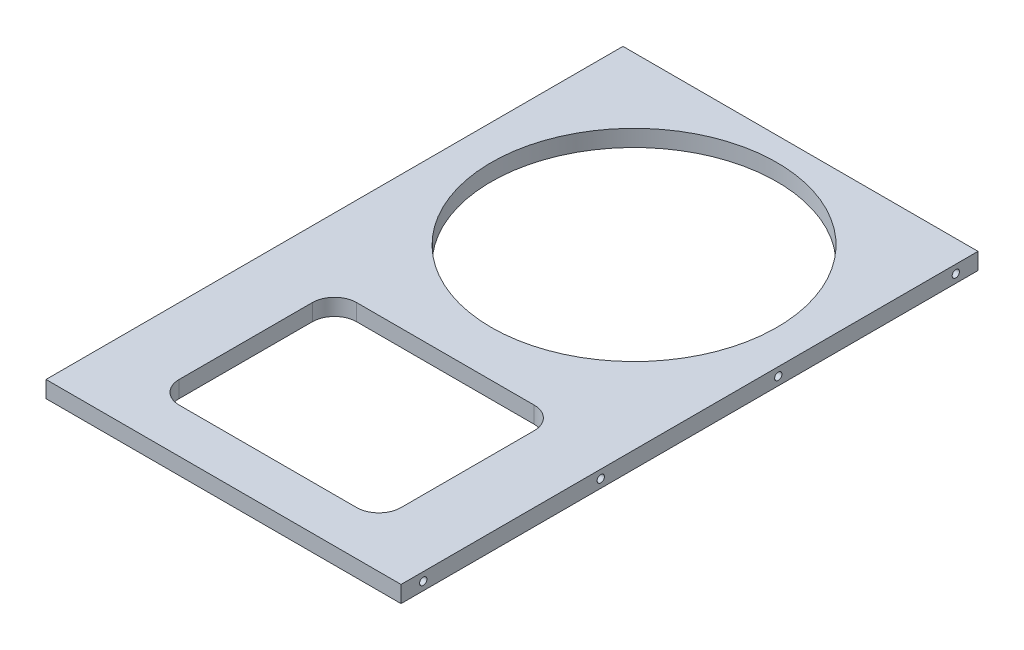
ISO-10303-21;
HEADER;
FILE_DESCRIPTION(('STEP AP214'),'2;1');
FILE_NAME('part.step','',(''),(''),'','','');
FILE_SCHEMA(('AUTOMOTIVE_DESIGN { 1 0 10303 214 1 1 1 1 }'));
ENDSEC;
DATA;
#1=APPLICATION_CONTEXT('core data for automotive mechanical design processes');
#2=APPLICATION_PROTOCOL_DEFINITION('international standard','automotive_design',2000,#1);
#3=PRODUCT_CONTEXT('',#1,'mechanical');
#4=PRODUCT('Part','Part','',(#3));
#5=PRODUCT_RELATED_PRODUCT_CATEGORY('part','',(#4));
#6=PRODUCT_DEFINITION_FORMATION('','',#4);
#7=PRODUCT_DEFINITION_CONTEXT('part definition',#1,'design');
#8=PRODUCT_DEFINITION('design','',#6,#7);
#9=PRODUCT_DEFINITION_SHAPE('','',#8);
#10=(LENGTH_UNIT() NAMED_UNIT(*) SI_UNIT(.MILLI.,.METRE.));
#11=(NAMED_UNIT(*) PLANE_ANGLE_UNIT() SI_UNIT($,.RADIAN.));
#12=(NAMED_UNIT(*) SI_UNIT($,.STERADIAN.) SOLID_ANGLE_UNIT());
#13=UNCERTAINTY_MEASURE_WITH_UNIT(LENGTH_MEASURE(1.E-05),#10,'distance_accuracy_value','');
#14=(GEOMETRIC_REPRESENTATION_CONTEXT(3) GLOBAL_UNCERTAINTY_ASSIGNED_CONTEXT((#13)) GLOBAL_UNIT_ASSIGNED_CONTEXT((#10,
#11,#12)) REPRESENTATION_CONTEXT('',''));
#15=CARTESIAN_POINT('',(0.,0.,0.));
#16=DIRECTION('',(0.,0.,1.));
#17=DIRECTION('',(1.,0.,0.));
#18=AXIS2_PLACEMENT_3D('',#15,#16,#17);
#19=CARTESIAN_POINT('',(0.,9.525,0.));
#20=DIRECTION('',(1.,0.,0.));
#21=DIRECTION('',(0.,0.,-1.));
#22=AXIS2_PLACEMENT_3D('',#19,#20,#21);
#23=PLANE('',#22);
#24=CARTESIAN_POINT('',(0.,4.7625,-317.5));
#25=DIRECTION('',(-1.,0.,0.));
#26=DIRECTION('',(0.,0.,1.));
#27=AXIS2_PLACEMENT_3D('',#24,#25,#26);
#28=CIRCLE('',#27,2.08280000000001);
#29=CARTESIAN_POINT('',(0.,4.7625,-315.4172));
#30=VERTEX_POINT('',#29);
#31=EDGE_CURVE('E232',#30,#30,#28,.T.);
#32=ORIENTED_EDGE('',*,*,#31,.F.);
#33=EDGE_LOOP('',(#32));
#34=FACE_BOUND('',#33,.T.);
#35=CARTESIAN_POINT('',(0.,4.7625,-215.9));
#36=DIRECTION('',(-1.,0.,0.));
#37=DIRECTION('',(0.,0.,1.));
#38=AXIS2_PLACEMENT_3D('',#35,#36,#37);
#39=CIRCLE('',#38,2.08279999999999);
#40=CARTESIAN_POINT('',(0.,4.7625,-213.8172));
#41=VERTEX_POINT('',#40);
#42=EDGE_CURVE('E240',#41,#41,#39,.T.);
#43=ORIENTED_EDGE('',*,*,#42,.F.);
#44=EDGE_LOOP('',(#43));
#45=FACE_BOUND('',#44,.T.);
#46=CARTESIAN_POINT('',(0.,4.7625,-114.3));
#47=DIRECTION('',(-1.,0.,0.));
#48=DIRECTION('',(0.,0.,1.));
#49=AXIS2_PLACEMENT_3D('',#46,#47,#48);
#50=CIRCLE('',#49,2.0828);
#51=CARTESIAN_POINT('',(0.,4.7625,-112.2172));
#52=VERTEX_POINT('',#51);
#53=EDGE_CURVE('E248',#52,#52,#50,.T.);
#54=ORIENTED_EDGE('',*,*,#53,.F.);
#55=EDGE_LOOP('',(#54));
#56=FACE_BOUND('',#55,.T.);
#57=CARTESIAN_POINT('',(0.,4.7625,-12.7));
#58=DIRECTION('',(-1.,0.,0.));
#59=DIRECTION('',(0.,0.,1.));
#60=AXIS2_PLACEMENT_3D('',#57,#58,#59);
#61=CIRCLE('',#60,2.0828);
#62=CARTESIAN_POINT('',(0.,4.7625,-10.6172));
#63=VERTEX_POINT('',#62);
#64=EDGE_CURVE('E256',#63,#63,#61,.T.);
#65=ORIENTED_EDGE('',*,*,#64,.F.);
#66=EDGE_LOOP('',(#65));
#67=FACE_BOUND('',#66,.T.);
#68=DIRECTION('',(0.,0.,1.));
#69=VECTOR('',#68,1.);
#70=CARTESIAN_POINT('',(0.,0.,0.));
#71=LINE('',#70,#69);
#72=CARTESIAN_POINT('',(0.,0.,-330.2));
#73=VERTEX_POINT('',#72);
#74=CARTESIAN_POINT('',(0.,0.,0.));
#75=VERTEX_POINT('',#74);
#76=EDGE_CURVE('E296',#73,#75,#71,.T.);
#77=ORIENTED_EDGE('',*,*,#76,.T.);
#78=DIRECTION('',(0.,-1.,0.));
#79=VECTOR('',#78,1.);
#80=CARTESIAN_POINT('',(0.,9.525,0.));
#81=LINE('',#80,#79);
#82=CARTESIAN_POINT('',(0.,9.525,0.));
#83=VERTEX_POINT('',#82);
#84=EDGE_CURVE('E11',#83,#75,#81,.T.);
#85=ORIENTED_EDGE('',*,*,#84,.F.);
#86=DIRECTION('',(0.,0.,1.));
#87=VECTOR('',#86,1.);
#88=CARTESIAN_POINT('',(0.,9.525,0.));
#89=LINE('',#88,#87);
#90=CARTESIAN_POINT('',(0.,9.525,-330.2));
#91=VERTEX_POINT('',#90);
#92=EDGE_CURVE('E300',#91,#83,#89,.T.);
#93=ORIENTED_EDGE('',*,*,#92,.F.);
#94=DIRECTION('',(0.,-1.,0.));
#95=VECTOR('',#94,1.);
#96=CARTESIAN_POINT('',(0.,9.525,-330.2));
#97=LINE('',#96,#95);
#98=EDGE_CURVE('E314',#91,#73,#97,.T.);
#99=ORIENTED_EDGE('',*,*,#98,.T.);
#100=EDGE_LOOP('',(#77,#85,#93,#99));
#101=FACE_BOUND('',#100,.T.);
#102=ADVANCED_FACE('F45',(#34,#45,#56,#67,#101),#23,.F.);
#103=CARTESIAN_POINT('',(0.,9.525,0.));
#104=DIRECTION('',(0.,0.,-1.));
#105=DIRECTION('',(-1.,0.,0.));
#106=AXIS2_PLACEMENT_3D('',#103,#104,#105);
#107=PLANE('',#106);
#108=DIRECTION('',(1.,0.,0.));
#109=VECTOR('',#108,1.);
#110=CARTESIAN_POINT('',(0.,0.,0.));
#111=LINE('',#110,#109);
#112=CARTESIAN_POINT('',(203.2,0.,0.));
#113=VERTEX_POINT('',#112);
#114=EDGE_CURVE('E318',#75,#113,#111,.T.);
#115=ORIENTED_EDGE('',*,*,#114,.T.);
#116=DIRECTION('',(0.,-1.,0.));
#117=VECTOR('',#116,1.);
#118=CARTESIAN_POINT('',(203.2,9.525,0.));
#119=LINE('',#118,#117);
#120=CARTESIAN_POINT('',(203.2,9.525,0.));
#121=VERTEX_POINT('',#120);
#122=EDGE_CURVE('E53',#121,#113,#119,.T.);
#123=ORIENTED_EDGE('',*,*,#122,.F.);
#124=DIRECTION('',(1.,0.,0.));
#125=VECTOR('',#124,1.);
#126=CARTESIAN_POINT('',(0.,9.525,0.));
#127=LINE('',#126,#125);
#128=EDGE_CURVE('E304',#83,#121,#127,.T.);
#129=ORIENTED_EDGE('',*,*,#128,.F.);
#130=ORIENTED_EDGE('',*,*,#84,.T.);
#131=EDGE_LOOP('',(#115,#123,#129,#130));
#132=FACE_BOUND('',#131,.T.);
#133=ADVANCED_FACE('F354',(#132),#107,.F.);
#134=CARTESIAN_POINT('',(203.2,9.525,0.));
#135=DIRECTION('',(-1.,0.,0.));
#136=DIRECTION('',(0.,0.,1.));
#137=AXIS2_PLACEMENT_3D('',#134,#135,#136);
#138=PLANE('',#137);
#139=CARTESIAN_POINT('',(203.2,4.7625,-317.5));
#140=DIRECTION('',(1.,0.,0.));
#141=DIRECTION('',(0.,0.,-1.));
#142=AXIS2_PLACEMENT_3D('',#139,#140,#141);
#143=CIRCLE('',#142,2.08280000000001);
#144=CARTESIAN_POINT('',(203.2,4.7625,-319.5828));
#145=VERTEX_POINT('',#144);
#146=EDGE_CURVE('E264',#145,#145,#143,.T.);
#147=ORIENTED_EDGE('',*,*,#146,.F.);
#148=EDGE_LOOP('',(#147));
#149=FACE_BOUND('',#148,.T.);
#150=CARTESIAN_POINT('',(203.2,4.7625,-215.9));
#151=DIRECTION('',(1.,0.,0.));
#152=DIRECTION('',(0.,0.,-1.));
#153=AXIS2_PLACEMENT_3D('',#150,#151,#152);
#154=CIRCLE('',#153,2.08279999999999);
#155=CARTESIAN_POINT('',(203.2,4.7625,-217.9828));
#156=VERTEX_POINT('',#155);
#157=EDGE_CURVE('E272',#156,#156,#154,.T.);
#158=ORIENTED_EDGE('',*,*,#157,.F.);
#159=EDGE_LOOP('',(#158));
#160=FACE_BOUND('',#159,.T.);
#161=CARTESIAN_POINT('',(203.2,4.7625,-114.3));
#162=DIRECTION('',(1.,0.,0.));
#163=DIRECTION('',(0.,0.,-1.));
#164=AXIS2_PLACEMENT_3D('',#161,#162,#163);
#165=CIRCLE('',#164,2.0828);
#166=CARTESIAN_POINT('',(203.2,4.7625,-116.3828));
#167=VERTEX_POINT('',#166);
#168=EDGE_CURVE('E280',#167,#167,#165,.T.);
#169=ORIENTED_EDGE('',*,*,#168,.F.);
#170=EDGE_LOOP('',(#169));
#171=FACE_BOUND('',#170,.T.);
#172=CARTESIAN_POINT('',(203.2,4.7625,-12.7));
#173=DIRECTION('',(1.,0.,0.));
#174=DIRECTION('',(0.,0.,-1.));
#175=AXIS2_PLACEMENT_3D('',#172,#173,#174);
#176=CIRCLE('',#175,2.0828);
#177=CARTESIAN_POINT('',(203.2,4.7625,-14.7828));
#178=VERTEX_POINT('',#177);
#179=EDGE_CURVE('E288',#178,#178,#176,.T.);
#180=ORIENTED_EDGE('',*,*,#179,.F.);
#181=EDGE_LOOP('',(#180));
#182=FACE_BOUND('',#181,.T.);
#183=DIRECTION('',(0.,0.,-1.));
#184=VECTOR('',#183,1.);
#185=CARTESIAN_POINT('',(203.2,0.,0.));
#186=LINE('',#185,#184);
#187=CARTESIAN_POINT('',(203.2,0.,-330.2));
#188=VERTEX_POINT('',#187);
#189=EDGE_CURVE('E321',#113,#188,#186,.T.);
#190=ORIENTED_EDGE('',*,*,#189,.T.);
#191=DIRECTION('',(0.,-1.,0.));
#192=VECTOR('',#191,1.);
#193=CARTESIAN_POINT('',(203.2,9.525,-330.2));
#194=LINE('',#193,#192);
#195=CARTESIAN_POINT('',(203.2,9.525,-330.2));
#196=VERTEX_POINT('',#195);
#197=EDGE_CURVE('E329',#196,#188,#194,.T.);
#198=ORIENTED_EDGE('',*,*,#197,.F.);
#199=DIRECTION('',(0.,0.,-1.));
#200=VECTOR('',#199,1.);
#201=CARTESIAN_POINT('',(203.2,9.525,0.));
#202=LINE('',#201,#200);
#203=EDGE_CURVE('E308',#121,#196,#202,.T.);
#204=ORIENTED_EDGE('',*,*,#203,.F.);
#205=ORIENTED_EDGE('',*,*,#122,.T.);
#206=EDGE_LOOP('',(#190,#198,#204,#205));
#207=FACE_BOUND('',#206,.T.);
#208=ADVANCED_FACE('F339',(#149,#160,#171,#182,#207),#138,.F.);
#209=CARTESIAN_POINT('',(0.,9.525,-330.2));
#210=DIRECTION('',(0.,0.,1.));
#211=DIRECTION('',(1.,0.,0.));
#212=AXIS2_PLACEMENT_3D('',#209,#210,#211);
#213=PLANE('',#212);
#214=DIRECTION('',(-1.,0.,0.));
#215=VECTOR('',#214,1.);
#216=CARTESIAN_POINT('',(0.,0.,-330.2));
#217=LINE('',#216,#215);
#218=EDGE_CURVE('E305',#188,#73,#217,.T.);
#219=ORIENTED_EDGE('',*,*,#218,.T.);
#220=ORIENTED_EDGE('',*,*,#98,.F.);
#221=DIRECTION('',(-1.,0.,0.));
#222=VECTOR('',#221,1.);
#223=CARTESIAN_POINT('',(0.,9.525,-330.2));
#224=LINE('',#223,#222);
#225=EDGE_CURVE('E311',#196,#91,#224,.T.);
#226=ORIENTED_EDGE('',*,*,#225,.F.);
#227=ORIENTED_EDGE('',*,*,#197,.T.);
#228=EDGE_LOOP('',(#219,#220,#226,#227));
#229=FACE_BOUND('',#228,.T.);
#230=ADVANCED_FACE('F347',(#229),#213,.F.);
#231=CARTESIAN_POINT('',(0.,9.525,-330.2));
#232=DIRECTION('',(0.,-1.,0.));
#233=DIRECTION('',(0.,0.,-1.));
#234=AXIS2_PLACEMENT_3D('',#231,#232,#233);
#235=PLANE('',#234);
#236=DIRECTION('',(0.,0.,1.));
#237=VECTOR('',#236,1.);
#238=CARTESIAN_POINT('',(38.1,9.525,-114.3));
#239=LINE('',#238,#237);
#240=CARTESIAN_POINT('',(38.1,9.525,-114.3));
#241=VERTEX_POINT('',#240);
#242=CARTESIAN_POINT('',(38.1,9.525,-38.1));
#243=VERTEX_POINT('',#242);
#244=EDGE_CURVE('E185',#241,#243,#239,.T.);
#245=ORIENTED_EDGE('',*,*,#244,.F.);
#246=CARTESIAN_POINT('',(50.8,9.525,-114.3));
#247=DIRECTION('',(0.,1.,0.));
#248=DIRECTION('',(0.,0.,1.));
#249=AXIS2_PLACEMENT_3D('',#246,#247,#248);
#250=CIRCLE('',#249,12.7);
#251=CARTESIAN_POINT('',(50.8,9.525,-127.));
#252=VERTEX_POINT('',#251);
#253=EDGE_CURVE('E60',#252,#241,#250,.T.);
#254=ORIENTED_EDGE('',*,*,#253,.F.);
#255=DIRECTION('',(-1.,0.,0.));
#256=VECTOR('',#255,1.);
#257=CARTESIAN_POINT('',(50.8,9.525,-127.));
#258=LINE('',#257,#256);
#259=CARTESIAN_POINT('',(152.4,9.525,-127.));
#260=VERTEX_POINT('',#259);
#261=EDGE_CURVE('E156',#260,#252,#258,.T.);
#262=ORIENTED_EDGE('',*,*,#261,.F.);
#263=CARTESIAN_POINT('',(152.4,9.525,-114.3));
#264=DIRECTION('',(0.,1.,0.));
#265=DIRECTION('',(0.,0.,1.));
#266=AXIS2_PLACEMENT_3D('',#263,#264,#265);
#267=CIRCLE('',#266,12.7);
#268=CARTESIAN_POINT('',(165.1,9.525,-114.3));
#269=VERTEX_POINT('',#268);
#270=EDGE_CURVE('E161',#269,#260,#267,.T.);
#271=ORIENTED_EDGE('',*,*,#270,.F.);
#272=DIRECTION('',(0.,0.,-1.));
#273=VECTOR('',#272,1.);
#274=CARTESIAN_POINT('',(165.1,9.525,-114.3));
#275=LINE('',#274,#273);
#276=CARTESIAN_POINT('',(165.1,9.525,-38.1));
#277=VERTEX_POINT('',#276);
#278=EDGE_CURVE('E200',#277,#269,#275,.T.);
#279=ORIENTED_EDGE('',*,*,#278,.F.);
#280=CARTESIAN_POINT('',(152.4,9.525,-38.1));
#281=DIRECTION('',(0.,1.,0.));
#282=DIRECTION('',(0.,0.,1.));
#283=AXIS2_PLACEMENT_3D('',#280,#281,#282);
#284=CIRCLE('',#283,12.7);
#285=CARTESIAN_POINT('',(152.4,9.525,-25.4));
#286=VERTEX_POINT('',#285);
#287=EDGE_CURVE('E196',#286,#277,#284,.T.);
#288=ORIENTED_EDGE('',*,*,#287,.F.);
#289=DIRECTION('',(1.,0.,0.));
#290=VECTOR('',#289,1.);
#291=CARTESIAN_POINT('',(50.8,9.525,-25.4));
#292=LINE('',#291,#290);
#293=CARTESIAN_POINT('',(50.8,9.525,-25.4));
#294=VERTEX_POINT('',#293);
#295=EDGE_CURVE('E192',#294,#286,#292,.T.);
#296=ORIENTED_EDGE('',*,*,#295,.F.);
#297=CARTESIAN_POINT('',(50.8,9.525,-38.1));
#298=DIRECTION('',(0.,1.,0.));
#299=DIRECTION('',(0.,0.,1.));
#300=AXIS2_PLACEMENT_3D('',#297,#298,#299);
#301=CIRCLE('',#300,12.7);
#302=EDGE_CURVE('E188',#243,#294,#301,.T.);
#303=ORIENTED_EDGE('',*,*,#302,.F.);
#304=EDGE_LOOP('',(#245,#254,#262,#271,#279,#288,#296,#303));
#305=FACE_BOUND('',#304,.T.);
#306=CARTESIAN_POINT('',(101.6,9.525,-234.95));
#307=DIRECTION('',(0.,1.,0.));
#308=DIRECTION('',(0.,0.,1.));
#309=AXIS2_PLACEMENT_3D('',#306,#307,#308);
#310=CIRCLE('',#309,81.75625);
#311=CARTESIAN_POINT('',(101.6,9.525,-153.19375));
#312=VERTEX_POINT('',#311);
#313=EDGE_CURVE('E210',#312,#312,#310,.T.);
#314=ORIENTED_EDGE('',*,*,#313,.F.);
#315=EDGE_LOOP('',(#314));
#316=FACE_BOUND('',#315,.T.);
#317=ORIENTED_EDGE('',*,*,#92,.T.);
#318=ORIENTED_EDGE('',*,*,#128,.T.);
#319=ORIENTED_EDGE('',*,*,#203,.T.);
#320=ORIENTED_EDGE('',*,*,#225,.T.);
#321=EDGE_LOOP('',(#317,#318,#319,#320));
#322=FACE_BOUND('',#321,.T.);
#323=ADVANCED_FACE('F353',(#305,#316,#322),#235,.F.);
#324=CARTESIAN_POINT('',(0.,0.,-330.2));
#325=DIRECTION('',(0.,-1.,0.));
#326=DIRECTION('',(0.,0.,-1.));
#327=AXIS2_PLACEMENT_3D('',#324,#325,#326);
#328=PLANE('',#327);
#329=CARTESIAN_POINT('',(50.8,0.,-114.3));
#330=DIRECTION('',(0.,1.,0.));
#331=DIRECTION('',(0.,0.,1.));
#332=AXIS2_PLACEMENT_3D('',#329,#330,#331);
#333=CIRCLE('',#332,12.7);
#334=CARTESIAN_POINT('',(50.8,0.,-127.));
#335=VERTEX_POINT('',#334);
#336=CARTESIAN_POINT('',(38.1,0.,-114.3));
#337=VERTEX_POINT('',#336);
#338=EDGE_CURVE('E136',#335,#337,#333,.T.);
#339=ORIENTED_EDGE('',*,*,#338,.T.);
#340=DIRECTION('',(0.,0.,1.));
#341=VECTOR('',#340,1.);
#342=CARTESIAN_POINT('',(38.1,0.,-114.3));
#343=LINE('',#342,#341);
#344=CARTESIAN_POINT('',(38.1,0.,-38.1));
#345=VERTEX_POINT('',#344);
#346=EDGE_CURVE('E146',#337,#345,#343,.T.);
#347=ORIENTED_EDGE('',*,*,#346,.T.);
#348=CARTESIAN_POINT('',(50.8,0.,-38.1));
#349=DIRECTION('',(0.,1.,0.));
#350=DIRECTION('',(0.,0.,1.));
#351=AXIS2_PLACEMENT_3D('',#348,#349,#350);
#352=CIRCLE('',#351,12.7);
#353=CARTESIAN_POINT('',(50.8,0.,-25.4));
#354=VERTEX_POINT('',#353);
#355=EDGE_CURVE('E68',#345,#354,#352,.T.);
#356=ORIENTED_EDGE('',*,*,#355,.T.);
#357=DIRECTION('',(1.,0.,0.));
#358=VECTOR('',#357,1.);
#359=CARTESIAN_POINT('',(50.8,0.,-25.4));
#360=LINE('',#359,#358);
#361=CARTESIAN_POINT('',(152.4,0.,-25.4));
#362=VERTEX_POINT('',#361);
#363=EDGE_CURVE('E166',#354,#362,#360,.T.);
#364=ORIENTED_EDGE('',*,*,#363,.T.);
#365=CARTESIAN_POINT('',(152.4,0.,-38.1));
#366=DIRECTION('',(0.,1.,0.));
#367=DIRECTION('',(0.,0.,1.));
#368=AXIS2_PLACEMENT_3D('',#365,#366,#367);
#369=CIRCLE('',#368,12.7);
#370=CARTESIAN_POINT('',(165.1,0.,-38.1));
#371=VERTEX_POINT('',#370);
#372=EDGE_CURVE('E170',#362,#371,#369,.T.);
#373=ORIENTED_EDGE('',*,*,#372,.T.);
#374=DIRECTION('',(0.,0.,-1.));
#375=VECTOR('',#374,1.);
#376=CARTESIAN_POINT('',(165.1,0.,-114.3));
#377=LINE('',#376,#375);
#378=CARTESIAN_POINT('',(165.1,0.,-114.3));
#379=VERTEX_POINT('',#378);
#380=EDGE_CURVE('E174',#371,#379,#377,.T.);
#381=ORIENTED_EDGE('',*,*,#380,.T.);
#382=CARTESIAN_POINT('',(152.4,0.,-114.3));
#383=DIRECTION('',(0.,1.,0.));
#384=DIRECTION('',(0.,0.,1.));
#385=AXIS2_PLACEMENT_3D('',#382,#383,#384);
#386=CIRCLE('',#385,12.7);
#387=CARTESIAN_POINT('',(152.4,0.,-127.));
#388=VERTEX_POINT('',#387);
#389=EDGE_CURVE('E178',#379,#388,#386,.T.);
#390=ORIENTED_EDGE('',*,*,#389,.T.);
#391=DIRECTION('',(-1.,0.,0.));
#392=VECTOR('',#391,1.);
#393=CARTESIAN_POINT('',(50.8,0.,-127.));
#394=LINE('',#393,#392);
#395=EDGE_CURVE('E143',#388,#335,#394,.T.);
#396=ORIENTED_EDGE('',*,*,#395,.T.);
#397=EDGE_LOOP('',(#339,#347,#356,#364,#373,#381,#390,#396));
#398=FACE_BOUND('',#397,.T.);
#399=CARTESIAN_POINT('',(101.6,0.,-234.95));
#400=DIRECTION('',(0.,1.,0.));
#401=DIRECTION('',(0.,0.,1.));
#402=AXIS2_PLACEMENT_3D('',#399,#400,#401);
#403=CIRCLE('',#402,81.75625);
#404=CARTESIAN_POINT('',(101.6,0.,-153.19375));
#405=VERTEX_POINT('',#404);
#406=EDGE_CURVE('E228',#405,#405,#403,.T.);
#407=ORIENTED_EDGE('',*,*,#406,.T.);
#408=EDGE_LOOP('',(#407));
#409=FACE_BOUND('',#408,.T.);
#410=ORIENTED_EDGE('',*,*,#76,.F.);
#411=ORIENTED_EDGE('',*,*,#218,.F.);
#412=ORIENTED_EDGE('',*,*,#189,.F.);
#413=ORIENTED_EDGE('',*,*,#114,.F.);
#414=EDGE_LOOP('',(#410,#411,#412,#413));
#415=FACE_BOUND('',#414,.T.);
#416=ADVANCED_FACE('F151',(#398,#409,#415),#328,.T.);
#417=CARTESIAN_POINT('',(184.15,4.7625,-12.7));
#418=DIRECTION('',(1.,0.,0.));
#419=DIRECTION('',(0.,0.,-1.));
#420=AXIS2_PLACEMENT_3D('',#417,#418,#419);
#421=CYLINDRICAL_SURFACE('',#420,2.0828);
#422=CARTESIAN_POINT('',(184.15,4.7625,-12.7));
#423=DIRECTION('',(1.,0.,0.));
#424=DIRECTION('',(0.,0.,-1.));
#425=AXIS2_PLACEMENT_3D('',#422,#423,#424);
#426=CIRCLE('',#425,2.0828);
#427=CARTESIAN_POINT('',(184.15,4.7625,-14.7828));
#428=VERTEX_POINT('',#427);
#429=EDGE_CURVE('E292',#428,#428,#426,.T.);
#430=CARTESIAN_POINT('',(184.15,4.7625,-14.7828));
#431=CARTESIAN_POINT('',(184.3484375,4.7625,-14.7828));
#432=CARTESIAN_POINT('',(184.546875,4.7625,-14.7828));
#433=CARTESIAN_POINT('',(184.94375,4.7625,-14.7828));
#434=CARTESIAN_POINT('',(185.1421875,4.7625,-14.7828));
#435=CARTESIAN_POINT('',(185.5390625,4.7625,-14.7828));
#436=CARTESIAN_POINT('',(185.7375,4.7625,-14.7828));
#437=CARTESIAN_POINT('',(186.134375,4.7625,-14.7828));
#438=CARTESIAN_POINT('',(186.3328125,4.7625,-14.7828));
#439=CARTESIAN_POINT('',(186.7296875,4.7625,-14.7828));
#440=CARTESIAN_POINT('',(186.928125,4.7625,-14.7828));
#441=CARTESIAN_POINT('',(187.325,4.7625,-14.7828));
#442=CARTESIAN_POINT('',(187.5234375,4.7625,-14.7828));
#443=CARTESIAN_POINT('',(187.9203125,4.7625,-14.7828));
#444=CARTESIAN_POINT('',(188.11875,4.7625,-14.7828));
#445=CARTESIAN_POINT('',(188.515625,4.7625,-14.7828));
#446=CARTESIAN_POINT('',(188.7140625,4.7625,-14.7828));
#447=CARTESIAN_POINT('',(189.1109375,4.7625,-14.7828));
#448=CARTESIAN_POINT('',(189.309375,4.7625,-14.7828));
#449=CARTESIAN_POINT('',(189.70625,4.7625,-14.7828));
#450=CARTESIAN_POINT('',(189.9046875,4.7625,-14.7828));
#451=CARTESIAN_POINT('',(190.3015625,4.7625,-14.7828));
#452=CARTESIAN_POINT('',(190.5,4.7625,-14.7828));
#453=CARTESIAN_POINT('',(190.896875,4.7625,-14.7828));
#454=CARTESIAN_POINT('',(191.0953125,4.7625,-14.7828));
#455=CARTESIAN_POINT('',(191.4921875,4.7625,-14.7828));
#456=CARTESIAN_POINT('',(191.690625,4.7625,-14.7828));
#457=CARTESIAN_POINT('',(192.0875,4.7625,-14.7828));
#458=CARTESIAN_POINT('',(192.2859375,4.7625,-14.7828));
#459=CARTESIAN_POINT('',(192.6828125,4.7625,-14.7828));
#460=CARTESIAN_POINT('',(192.88125,4.7625,-14.7828));
#461=CARTESIAN_POINT('',(193.278125,4.7625,-14.7828));
#462=CARTESIAN_POINT('',(193.4765625,4.7625,-14.7828));
#463=CARTESIAN_POINT('',(193.8734375,4.7625,-14.7828));
#464=CARTESIAN_POINT('',(194.071875,4.7625,-14.7828));
#465=CARTESIAN_POINT('',(194.46875,4.7625,-14.7828));
#466=CARTESIAN_POINT('',(194.6671875,4.7625,-14.7828));
#467=CARTESIAN_POINT('',(195.0640625,4.7625,-14.7828));
#468=CARTESIAN_POINT('',(195.2625,4.7625,-14.7828));
#469=CARTESIAN_POINT('',(195.659375,4.7625,-14.7828));
#470=CARTESIAN_POINT('',(195.8578125,4.7625,-14.7828));
#471=CARTESIAN_POINT('',(196.2546875,4.7625,-14.7828));
#472=CARTESIAN_POINT('',(196.453125,4.7625,-14.7828));
#473=CARTESIAN_POINT('',(196.85,4.7625,-14.7828));
#474=CARTESIAN_POINT('',(197.0484375,4.7625,-14.7828));
#475=CARTESIAN_POINT('',(197.4453125,4.7625,-14.7828));
#476=CARTESIAN_POINT('',(197.64375,4.7625,-14.7828));
#477=CARTESIAN_POINT('',(198.040625,4.7625,-14.7828));
#478=CARTESIAN_POINT('',(198.2390625,4.7625,-14.7828));
#479=CARTESIAN_POINT('',(198.6359375,4.7625,-14.7828));
#480=CARTESIAN_POINT('',(198.834375,4.7625,-14.7828));
#481=CARTESIAN_POINT('',(199.23125,4.7625,-14.7828));
#482=CARTESIAN_POINT('',(199.4296875,4.7625,-14.7828));
#483=CARTESIAN_POINT('',(199.8265625,4.7625,-14.7828));
#484=CARTESIAN_POINT('',(200.025,4.7625,-14.7828));
#485=CARTESIAN_POINT('',(200.421875,4.7625,-14.7828));
#486=CARTESIAN_POINT('',(200.6203125,4.7625,-14.7828));
#487=CARTESIAN_POINT('',(201.0171875,4.7625,-14.7828));
#488=CARTESIAN_POINT('',(201.215625,4.7625,-14.7828));
#489=CARTESIAN_POINT('',(201.6125,4.7625,-14.7828));
#490=CARTESIAN_POINT('',(201.8109375,4.7625,-14.7828));
#491=CARTESIAN_POINT('',(202.2078125,4.7625,-14.7828));
#492=CARTESIAN_POINT('',(202.40625,4.7625,-14.7828));
#493=CARTESIAN_POINT('',(202.803125,4.7625,-14.7828));
#494=CARTESIAN_POINT('',(203.0015625,4.7625,-14.7828));
#495=CARTESIAN_POINT('',(203.2,4.7625,-14.7828));
#496=B_SPLINE_CURVE_WITH_KNOTS('',3,(#430,#431,#432,#433,#434,#435,#436,#437,#438,#439,#440,
#441,#442,#443,#444,#445,#446,#447,#448,#449,#450,#451,#452,#453,#454,#455,#456,#457,#458,#459,
#460,#461,#462,#463,#464,#465,#466,#467,#468,#469,#470,#471,#472,#473,#474,#475,#476,#477,#478,
#479,#480,#481,#482,#483,#484,#485,#486,#487,#488,#489,#490,#491,#492,#493,#494,#495),
.UNSPECIFIED.,.F.,.F.,(4,2,2,2,2,2,2,2,2,2,2,2,2,2,2,2,2,2,2,2,2,2,2,2,2,2,2,2,2,2,2,2,4),(0.,
0.595312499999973,1.19062499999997,1.78593749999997,2.38124999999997,2.97656249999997,
3.57187499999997,4.16718749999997,4.76249999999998,5.35781249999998,5.95312499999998,
6.54843749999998,7.14374999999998,7.73906249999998,8.33437499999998,8.92968749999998,
9.52499999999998,10.1203125,10.715625,11.3109375,11.90625,12.5015625,13.096875,13.6921875,
14.2875,14.8828125,15.478125,16.0734375,16.66875,17.2640625,17.859375,18.4546875,19.05),.UNSPECIFIED.);
#497=EDGE_CURVE('BSEAM368',#428,#178,#496,.T.);
#498=ORIENTED_EDGE('',*,*,#429,.F.);
#499=ORIENTED_EDGE('',*,*,#179,.T.);
#500=ORIENTED_EDGE('',*,*,#497,.T.);
#501=ORIENTED_EDGE('',*,*,#497,.F.);
#502=EDGE_LOOP('',(#498,#500,#499,#501));
#503=FACE_BOUND('',#502,.T.);
#504=ADVANCED_FACE('F368',(#503),#421,.F.);
#505=CARTESIAN_POINT('',(184.15,4.7625,-12.7));
#506=DIRECTION('',(1.,0.,0.));
#507=DIRECTION('',(0.,0.,-1.));
#508=AXIS2_PLACEMENT_3D('',#505,#506,#507);
#509=PLANE('',#508);
#510=ORIENTED_EDGE('',*,*,#429,.T.);
#511=EDGE_LOOP('',(#510));
#512=FACE_BOUND('',#511,.T.);
#513=ADVANCED_FACE('F374',(#512),#509,.T.);
#514=CARTESIAN_POINT('',(184.15,4.7625,-114.3));
#515=DIRECTION('',(1.,0.,0.));
#516=DIRECTION('',(0.,0.,-1.));
#517=AXIS2_PLACEMENT_3D('',#514,#515,#516);
#518=CYLINDRICAL_SURFACE('',#517,2.0828);
#519=CARTESIAN_POINT('',(184.15,4.7625,-114.3));
#520=DIRECTION('',(1.,0.,0.));
#521=DIRECTION('',(0.,0.,-1.));
#522=AXIS2_PLACEMENT_3D('',#519,#520,#521);
#523=CIRCLE('',#522,2.0828);
#524=CARTESIAN_POINT('',(184.15,4.7625,-116.3828));
#525=VERTEX_POINT('',#524);
#526=EDGE_CURVE('E284',#525,#525,#523,.T.);
#527=CARTESIAN_POINT('',(184.15,4.7625,-116.3828));
#528=CARTESIAN_POINT('',(184.3484375,4.7625,-116.3828));
#529=CARTESIAN_POINT('',(184.546875,4.7625,-116.3828));
#530=CARTESIAN_POINT('',(184.94375,4.7625,-116.3828));
#531=CARTESIAN_POINT('',(185.1421875,4.7625,-116.3828));
#532=CARTESIAN_POINT('',(185.5390625,4.7625,-116.3828));
#533=CARTESIAN_POINT('',(185.7375,4.7625,-116.3828));
#534=CARTESIAN_POINT('',(186.134375,4.7625,-116.3828));
#535=CARTESIAN_POINT('',(186.3328125,4.7625,-116.3828));
#536=CARTESIAN_POINT('',(186.7296875,4.7625,-116.3828));
#537=CARTESIAN_POINT('',(186.928125,4.7625,-116.3828));
#538=CARTESIAN_POINT('',(187.325,4.7625,-116.3828));
#539=CARTESIAN_POINT('',(187.5234375,4.7625,-116.3828));
#540=CARTESIAN_POINT('',(187.9203125,4.7625,-116.3828));
#541=CARTESIAN_POINT('',(188.11875,4.7625,-116.3828));
#542=CARTESIAN_POINT('',(188.515625,4.7625,-116.3828));
#543=CARTESIAN_POINT('',(188.7140625,4.7625,-116.3828));
#544=CARTESIAN_POINT('',(189.1109375,4.7625,-116.3828));
#545=CARTESIAN_POINT('',(189.309375,4.7625,-116.3828));
#546=CARTESIAN_POINT('',(189.70625,4.7625,-116.3828));
#547=CARTESIAN_POINT('',(189.9046875,4.7625,-116.3828));
#548=CARTESIAN_POINT('',(190.3015625,4.7625,-116.3828));
#549=CARTESIAN_POINT('',(190.5,4.7625,-116.3828));
#550=CARTESIAN_POINT('',(190.896875,4.7625,-116.3828));
#551=CARTESIAN_POINT('',(191.0953125,4.7625,-116.3828));
#552=CARTESIAN_POINT('',(191.4921875,4.7625,-116.3828));
#553=CARTESIAN_POINT('',(191.690625,4.7625,-116.3828));
#554=CARTESIAN_POINT('',(192.0875,4.7625,-116.3828));
#555=CARTESIAN_POINT('',(192.2859375,4.7625,-116.3828));
#556=CARTESIAN_POINT('',(192.6828125,4.7625,-116.3828));
#557=CARTESIAN_POINT('',(192.88125,4.7625,-116.3828));
#558=CARTESIAN_POINT('',(193.278125,4.7625,-116.3828));
#559=CARTESIAN_POINT('',(193.4765625,4.7625,-116.3828));
#560=CARTESIAN_POINT('',(193.8734375,4.7625,-116.3828));
#561=CARTESIAN_POINT('',(194.071875,4.7625,-116.3828));
#562=CARTESIAN_POINT('',(194.46875,4.7625,-116.3828));
#563=CARTESIAN_POINT('',(194.6671875,4.7625,-116.3828));
#564=CARTESIAN_POINT('',(195.0640625,4.7625,-116.3828));
#565=CARTESIAN_POINT('',(195.2625,4.7625,-116.3828));
#566=CARTESIAN_POINT('',(195.659375,4.7625,-116.3828));
#567=CARTESIAN_POINT('',(195.8578125,4.7625,-116.3828));
#568=CARTESIAN_POINT('',(196.2546875,4.7625,-116.3828));
#569=CARTESIAN_POINT('',(196.453125,4.7625,-116.3828));
#570=CARTESIAN_POINT('',(196.85,4.7625,-116.3828));
#571=CARTESIAN_POINT('',(197.0484375,4.7625,-116.3828));
#572=CARTESIAN_POINT('',(197.4453125,4.7625,-116.3828));
#573=CARTESIAN_POINT('',(197.64375,4.7625,-116.3828));
#574=CARTESIAN_POINT('',(198.040625,4.7625,-116.3828));
#575=CARTESIAN_POINT('',(198.2390625,4.7625,-116.3828));
#576=CARTESIAN_POINT('',(198.6359375,4.7625,-116.3828));
#577=CARTESIAN_POINT('',(198.834375,4.7625,-116.3828));
#578=CARTESIAN_POINT('',(199.23125,4.7625,-116.3828));
#579=CARTESIAN_POINT('',(199.4296875,4.7625,-116.3828));
#580=CARTESIAN_POINT('',(199.8265625,4.7625,-116.3828));
#581=CARTESIAN_POINT('',(200.025,4.7625,-116.3828));
#582=CARTESIAN_POINT('',(200.421875,4.7625,-116.3828));
#583=CARTESIAN_POINT('',(200.6203125,4.7625,-116.3828));
#584=CARTESIAN_POINT('',(201.0171875,4.7625,-116.3828));
#585=CARTESIAN_POINT('',(201.215625,4.7625,-116.3828));
#586=CARTESIAN_POINT('',(201.6125,4.7625,-116.3828));
#587=CARTESIAN_POINT('',(201.8109375,4.7625,-116.3828));
#588=CARTESIAN_POINT('',(202.2078125,4.7625,-116.3828));
#589=CARTESIAN_POINT('',(202.40625,4.7625,-116.3828));
#590=CARTESIAN_POINT('',(202.803125,4.7625,-116.3828));
#591=CARTESIAN_POINT('',(203.0015625,4.7625,-116.3828));
#592=CARTESIAN_POINT('',(203.2,4.7625,-116.3828));
#593=B_SPLINE_CURVE_WITH_KNOTS('',3,(#527,#528,#529,#530,#531,#532,#533,#534,#535,#536,#537,
#538,#539,#540,#541,#542,#543,#544,#545,#546,#547,#548,#549,#550,#551,#552,#553,#554,#555,#556,
#557,#558,#559,#560,#561,#562,#563,#564,#565,#566,#567,#568,#569,#570,#571,#572,#573,#574,#575,
#576,#577,#578,#579,#580,#581,#582,#583,#584,#585,#586,#587,#588,#589,#590,#591,#592),
.UNSPECIFIED.,.F.,.F.,(4,2,2,2,2,2,2,2,2,2,2,2,2,2,2,2,2,2,2,2,2,2,2,2,2,2,2,2,2,2,2,2,4),(0.,
0.595312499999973,1.19062499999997,1.78593749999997,2.38124999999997,2.97656249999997,
3.57187499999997,4.16718749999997,4.76249999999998,5.35781249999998,5.95312499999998,
6.54843749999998,7.14374999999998,7.73906249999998,8.33437499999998,8.92968749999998,
9.52499999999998,10.1203125,10.715625,11.3109375,11.90625,12.5015625,13.096875,13.6921875,
14.2875,14.8828125,15.478125,16.0734375,16.66875,17.2640625,17.859375,18.4546875,19.05),.UNSPECIFIED.);
#594=EDGE_CURVE('BSEAM378',#525,#167,#593,.T.);
#595=ORIENTED_EDGE('',*,*,#526,.F.);
#596=ORIENTED_EDGE('',*,*,#168,.T.);
#597=ORIENTED_EDGE('',*,*,#594,.T.);
#598=ORIENTED_EDGE('',*,*,#594,.F.);
#599=EDGE_LOOP('',(#595,#597,#596,#598));
#600=FACE_BOUND('',#599,.T.);
#601=ADVANCED_FACE('F378',(#600),#518,.F.);
#602=CARTESIAN_POINT('',(184.15,4.7625,-114.3));
#603=DIRECTION('',(1.,0.,0.));
#604=DIRECTION('',(0.,0.,-1.));
#605=AXIS2_PLACEMENT_3D('',#602,#603,#604);
#606=PLANE('',#605);
#607=ORIENTED_EDGE('',*,*,#526,.T.);
#608=EDGE_LOOP('',(#607));
#609=FACE_BOUND('',#608,.T.);
#610=ADVANCED_FACE('F382',(#609),#606,.T.);
#611=CARTESIAN_POINT('',(184.15,4.7625,-215.9));
#612=DIRECTION('',(1.,0.,0.));
#613=DIRECTION('',(0.,0.,-1.));
#614=AXIS2_PLACEMENT_3D('',#611,#612,#613);
#615=CYLINDRICAL_SURFACE('',#614,2.08279999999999);
#616=CARTESIAN_POINT('',(184.15,4.7625,-215.9));
#617=DIRECTION('',(1.,0.,0.));
#618=DIRECTION('',(0.,0.,-1.));
#619=AXIS2_PLACEMENT_3D('',#616,#617,#618);
#620=CIRCLE('',#619,2.08279999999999);
#621=CARTESIAN_POINT('',(184.15,4.7625,-217.9828));
#622=VERTEX_POINT('',#621);
#623=EDGE_CURVE('E276',#622,#622,#620,.T.);
#624=CARTESIAN_POINT('',(184.15,4.7625,-217.9828));
#625=CARTESIAN_POINT('',(184.3484375,4.7625,-217.9828));
#626=CARTESIAN_POINT('',(184.546875,4.7625,-217.9828));
#627=CARTESIAN_POINT('',(184.94375,4.7625,-217.9828));
#628=CARTESIAN_POINT('',(185.1421875,4.7625,-217.9828));
#629=CARTESIAN_POINT('',(185.5390625,4.7625,-217.9828));
#630=CARTESIAN_POINT('',(185.7375,4.7625,-217.9828));
#631=CARTESIAN_POINT('',(186.134375,4.7625,-217.9828));
#632=CARTESIAN_POINT('',(186.3328125,4.7625,-217.9828));
#633=CARTESIAN_POINT('',(186.7296875,4.7625,-217.9828));
#634=CARTESIAN_POINT('',(186.928125,4.7625,-217.9828));
#635=CARTESIAN_POINT('',(187.325,4.7625,-217.9828));
#636=CARTESIAN_POINT('',(187.5234375,4.7625,-217.9828));
#637=CARTESIAN_POINT('',(187.9203125,4.7625,-217.9828));
#638=CARTESIAN_POINT('',(188.11875,4.7625,-217.9828));
#639=CARTESIAN_POINT('',(188.515625,4.7625,-217.9828));
#640=CARTESIAN_POINT('',(188.7140625,4.7625,-217.9828));
#641=CARTESIAN_POINT('',(189.1109375,4.7625,-217.9828));
#642=CARTESIAN_POINT('',(189.309375,4.7625,-217.9828));
#643=CARTESIAN_POINT('',(189.70625,4.7625,-217.9828));
#644=CARTESIAN_POINT('',(189.9046875,4.7625,-217.9828));
#645=CARTESIAN_POINT('',(190.3015625,4.7625,-217.9828));
#646=CARTESIAN_POINT('',(190.5,4.7625,-217.9828));
#647=CARTESIAN_POINT('',(190.896875,4.7625,-217.9828));
#648=CARTESIAN_POINT('',(191.0953125,4.7625,-217.9828));
#649=CARTESIAN_POINT('',(191.4921875,4.7625,-217.9828));
#650=CARTESIAN_POINT('',(191.690625,4.7625,-217.9828));
#651=CARTESIAN_POINT('',(192.0875,4.7625,-217.9828));
#652=CARTESIAN_POINT('',(192.2859375,4.7625,-217.9828));
#653=CARTESIAN_POINT('',(192.6828125,4.7625,-217.9828));
#654=CARTESIAN_POINT('',(192.88125,4.7625,-217.9828));
#655=CARTESIAN_POINT('',(193.278125,4.7625,-217.9828));
#656=CARTESIAN_POINT('',(193.4765625,4.7625,-217.9828));
#657=CARTESIAN_POINT('',(193.8734375,4.7625,-217.9828));
#658=CARTESIAN_POINT('',(194.071875,4.7625,-217.9828));
#659=CARTESIAN_POINT('',(194.46875,4.7625,-217.9828));
#660=CARTESIAN_POINT('',(194.6671875,4.7625,-217.9828));
#661=CARTESIAN_POINT('',(195.0640625,4.7625,-217.9828));
#662=CARTESIAN_POINT('',(195.2625,4.7625,-217.9828));
#663=CARTESIAN_POINT('',(195.659375,4.7625,-217.9828));
#664=CARTESIAN_POINT('',(195.8578125,4.7625,-217.9828));
#665=CARTESIAN_POINT('',(196.2546875,4.7625,-217.9828));
#666=CARTESIAN_POINT('',(196.453125,4.7625,-217.9828));
#667=CARTESIAN_POINT('',(196.85,4.7625,-217.9828));
#668=CARTESIAN_POINT('',(197.0484375,4.7625,-217.9828));
#669=CARTESIAN_POINT('',(197.4453125,4.7625,-217.9828));
#670=CARTESIAN_POINT('',(197.64375,4.7625,-217.9828));
#671=CARTESIAN_POINT('',(198.040625,4.7625,-217.9828));
#672=CARTESIAN_POINT('',(198.2390625,4.7625,-217.9828));
#673=CARTESIAN_POINT('',(198.6359375,4.7625,-217.9828));
#674=CARTESIAN_POINT('',(198.834375,4.7625,-217.9828));
#675=CARTESIAN_POINT('',(199.23125,4.7625,-217.9828));
#676=CARTESIAN_POINT('',(199.4296875,4.7625,-217.9828));
#677=CARTESIAN_POINT('',(199.8265625,4.7625,-217.9828));
#678=CARTESIAN_POINT('',(200.025,4.7625,-217.9828));
#679=CARTESIAN_POINT('',(200.421875,4.7625,-217.9828));
#680=CARTESIAN_POINT('',(200.6203125,4.7625,-217.9828));
#681=CARTESIAN_POINT('',(201.0171875,4.7625,-217.9828));
#682=CARTESIAN_POINT('',(201.215625,4.7625,-217.9828));
#683=CARTESIAN_POINT('',(201.6125,4.7625,-217.9828));
#684=CARTESIAN_POINT('',(201.8109375,4.7625,-217.9828));
#685=CARTESIAN_POINT('',(202.2078125,4.7625,-217.9828));
#686=CARTESIAN_POINT('',(202.40625,4.7625,-217.9828));
#687=CARTESIAN_POINT('',(202.803125,4.7625,-217.9828));
#688=CARTESIAN_POINT('',(203.0015625,4.7625,-217.9828));
#689=CARTESIAN_POINT('',(203.2,4.7625,-217.9828));
#690=B_SPLINE_CURVE_WITH_KNOTS('',3,(#624,#625,#626,#627,#628,#629,#630,#631,#632,#633,#634,
#635,#636,#637,#638,#639,#640,#641,#642,#643,#644,#645,#646,#647,#648,#649,#650,#651,#652,#653,
#654,#655,#656,#657,#658,#659,#660,#661,#662,#663,#664,#665,#666,#667,#668,#669,#670,#671,#672,
#673,#674,#675,#676,#677,#678,#679,#680,#681,#682,#683,#684,#685,#686,#687,#688,#689),
.UNSPECIFIED.,.F.,.F.,(4,2,2,2,2,2,2,2,2,2,2,2,2,2,2,2,2,2,2,2,2,2,2,2,2,2,2,2,2,2,2,2,4),(0.,
0.595312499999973,1.19062499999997,1.78593749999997,2.38124999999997,2.97656249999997,
3.57187499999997,4.16718749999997,4.76249999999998,5.35781249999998,5.95312499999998,
6.54843749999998,7.14374999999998,7.73906249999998,8.33437499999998,8.92968749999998,
9.52499999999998,10.1203125,10.715625,11.3109375,11.90625,12.5015625,13.096875,13.6921875,
14.2875,14.8828125,15.478125,16.0734375,16.66875,17.2640625,17.859375,18.4546875,19.05),.UNSPECIFIED.);
#691=EDGE_CURVE('BSEAM386',#622,#156,#690,.T.);
#692=ORIENTED_EDGE('',*,*,#623,.F.);
#693=ORIENTED_EDGE('',*,*,#157,.T.);
#694=ORIENTED_EDGE('',*,*,#691,.T.);
#695=ORIENTED_EDGE('',*,*,#691,.F.);
#696=EDGE_LOOP('',(#692,#694,#693,#695));
#697=FACE_BOUND('',#696,.T.);
#698=ADVANCED_FACE('F386',(#697),#615,.F.);
#699=CARTESIAN_POINT('',(184.15,4.7625,-215.9));
#700=DIRECTION('',(1.,0.,0.));
#701=DIRECTION('',(0.,0.,-1.));
#702=AXIS2_PLACEMENT_3D('',#699,#700,#701);
#703=PLANE('',#702);
#704=ORIENTED_EDGE('',*,*,#623,.T.);
#705=EDGE_LOOP('',(#704));
#706=FACE_BOUND('',#705,.T.);
#707=ADVANCED_FACE('F390',(#706),#703,.T.);
#708=CARTESIAN_POINT('',(184.15,4.7625,-317.5));
#709=DIRECTION('',(1.,0.,0.));
#710=DIRECTION('',(0.,0.,-1.));
#711=AXIS2_PLACEMENT_3D('',#708,#709,#710);
#712=CYLINDRICAL_SURFACE('',#711,2.08280000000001);
#713=CARTESIAN_POINT('',(184.15,4.7625,-317.5));
#714=DIRECTION('',(1.,0.,0.));
#715=DIRECTION('',(0.,0.,-1.));
#716=AXIS2_PLACEMENT_3D('',#713,#714,#715);
#717=CIRCLE('',#716,2.08280000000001);
#718=CARTESIAN_POINT('',(184.15,4.7625,-319.5828));
#719=VERTEX_POINT('',#718);
#720=EDGE_CURVE('E268',#719,#719,#717,.T.);
#721=CARTESIAN_POINT('',(184.15,4.7625,-319.5828));
#722=CARTESIAN_POINT('',(184.3484375,4.7625,-319.5828));
#723=CARTESIAN_POINT('',(184.546875,4.7625,-319.5828));
#724=CARTESIAN_POINT('',(184.94375,4.7625,-319.5828));
#725=CARTESIAN_POINT('',(185.1421875,4.7625,-319.5828));
#726=CARTESIAN_POINT('',(185.5390625,4.7625,-319.5828));
#727=CARTESIAN_POINT('',(185.7375,4.7625,-319.5828));
#728=CARTESIAN_POINT('',(186.134375,4.7625,-319.5828));
#729=CARTESIAN_POINT('',(186.3328125,4.7625,-319.5828));
#730=CARTESIAN_POINT('',(186.7296875,4.7625,-319.5828));
#731=CARTESIAN_POINT('',(186.928125,4.7625,-319.5828));
#732=CARTESIAN_POINT('',(187.325,4.7625,-319.5828));
#733=CARTESIAN_POINT('',(187.5234375,4.7625,-319.5828));
#734=CARTESIAN_POINT('',(187.9203125,4.7625,-319.5828));
#735=CARTESIAN_POINT('',(188.11875,4.7625,-319.5828));
#736=CARTESIAN_POINT('',(188.515625,4.7625,-319.5828));
#737=CARTESIAN_POINT('',(188.7140625,4.7625,-319.5828));
#738=CARTESIAN_POINT('',(189.1109375,4.7625,-319.5828));
#739=CARTESIAN_POINT('',(189.309375,4.7625,-319.5828));
#740=CARTESIAN_POINT('',(189.70625,4.7625,-319.5828));
#741=CARTESIAN_POINT('',(189.9046875,4.7625,-319.5828));
#742=CARTESIAN_POINT('',(190.3015625,4.7625,-319.5828));
#743=CARTESIAN_POINT('',(190.5,4.7625,-319.5828));
#744=CARTESIAN_POINT('',(190.896875,4.7625,-319.5828));
#745=CARTESIAN_POINT('',(191.0953125,4.7625,-319.5828));
#746=CARTESIAN_POINT('',(191.4921875,4.7625,-319.5828));
#747=CARTESIAN_POINT('',(191.690625,4.7625,-319.5828));
#748=CARTESIAN_POINT('',(192.0875,4.7625,-319.5828));
#749=CARTESIAN_POINT('',(192.2859375,4.7625,-319.5828));
#750=CARTESIAN_POINT('',(192.6828125,4.7625,-319.5828));
#751=CARTESIAN_POINT('',(192.88125,4.7625,-319.5828));
#752=CARTESIAN_POINT('',(193.278125,4.7625,-319.5828));
#753=CARTESIAN_POINT('',(193.4765625,4.7625,-319.5828));
#754=CARTESIAN_POINT('',(193.8734375,4.7625,-319.5828));
#755=CARTESIAN_POINT('',(194.071875,4.7625,-319.5828));
#756=CARTESIAN_POINT('',(194.46875,4.7625,-319.5828));
#757=CARTESIAN_POINT('',(194.6671875,4.7625,-319.5828));
#758=CARTESIAN_POINT('',(195.0640625,4.7625,-319.5828));
#759=CARTESIAN_POINT('',(195.2625,4.7625,-319.5828));
#760=CARTESIAN_POINT('',(195.659375,4.7625,-319.5828));
#761=CARTESIAN_POINT('',(195.8578125,4.7625,-319.5828));
#762=CARTESIAN_POINT('',(196.2546875,4.7625,-319.5828));
#763=CARTESIAN_POINT('',(196.453125,4.7625,-319.5828));
#764=CARTESIAN_POINT('',(196.85,4.7625,-319.5828));
#765=CARTESIAN_POINT('',(197.0484375,4.7625,-319.5828));
#766=CARTESIAN_POINT('',(197.4453125,4.7625,-319.5828));
#767=CARTESIAN_POINT('',(197.64375,4.7625,-319.5828));
#768=CARTESIAN_POINT('',(198.040625,4.7625,-319.5828));
#769=CARTESIAN_POINT('',(198.2390625,4.7625,-319.5828));
#770=CARTESIAN_POINT('',(198.6359375,4.7625,-319.5828));
#771=CARTESIAN_POINT('',(198.834375,4.7625,-319.5828));
#772=CARTESIAN_POINT('',(199.23125,4.7625,-319.5828));
#773=CARTESIAN_POINT('',(199.4296875,4.7625,-319.5828));
#774=CARTESIAN_POINT('',(199.8265625,4.7625,-319.5828));
#775=CARTESIAN_POINT('',(200.025,4.7625,-319.5828));
#776=CARTESIAN_POINT('',(200.421875,4.7625,-319.5828));
#777=CARTESIAN_POINT('',(200.6203125,4.7625,-319.5828));
#778=CARTESIAN_POINT('',(201.0171875,4.7625,-319.5828));
#779=CARTESIAN_POINT('',(201.215625,4.7625,-319.5828));
#780=CARTESIAN_POINT('',(201.6125,4.7625,-319.5828));
#781=CARTESIAN_POINT('',(201.8109375,4.7625,-319.5828));
#782=CARTESIAN_POINT('',(202.2078125,4.7625,-319.5828));
#783=CARTESIAN_POINT('',(202.40625,4.7625,-319.5828));
#784=CARTESIAN_POINT('',(202.803125,4.7625,-319.5828));
#785=CARTESIAN_POINT('',(203.0015625,4.7625,-319.5828));
#786=CARTESIAN_POINT('',(203.2,4.7625,-319.5828));
#787=B_SPLINE_CURVE_WITH_KNOTS('',3,(#721,#722,#723,#724,#725,#726,#727,#728,#729,#730,#731,
#732,#733,#734,#735,#736,#737,#738,#739,#740,#741,#742,#743,#744,#745,#746,#747,#748,#749,#750,
#751,#752,#753,#754,#755,#756,#757,#758,#759,#760,#761,#762,#763,#764,#765,#766,#767,#768,#769,
#770,#771,#772,#773,#774,#775,#776,#777,#778,#779,#780,#781,#782,#783,#784,#785,#786),
.UNSPECIFIED.,.F.,.F.,(4,2,2,2,2,2,2,2,2,2,2,2,2,2,2,2,2,2,2,2,2,2,2,2,2,2,2,2,2,2,2,2,4),(0.,
0.595312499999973,1.19062499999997,1.78593749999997,2.38124999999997,2.97656249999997,
3.57187499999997,4.16718749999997,4.76249999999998,5.35781249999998,5.95312499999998,
6.54843749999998,7.14374999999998,7.73906249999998,8.33437499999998,8.92968749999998,
9.52499999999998,10.1203125,10.715625,11.3109375,11.90625,12.5015625,13.096875,13.6921875,
14.2875,14.8828125,15.478125,16.0734375,16.66875,17.2640625,17.859375,18.4546875,19.05),.UNSPECIFIED.);
#788=EDGE_CURVE('BSEAM394',#719,#145,#787,.T.);
#789=ORIENTED_EDGE('',*,*,#720,.F.);
#790=ORIENTED_EDGE('',*,*,#146,.T.);
#791=ORIENTED_EDGE('',*,*,#788,.T.);
#792=ORIENTED_EDGE('',*,*,#788,.F.);
#793=EDGE_LOOP('',(#789,#791,#790,#792));
#794=FACE_BOUND('',#793,.T.);
#795=ADVANCED_FACE('F394',(#794),#712,.F.);
#796=CARTESIAN_POINT('',(184.15,4.7625,-317.5));
#797=DIRECTION('',(1.,0.,0.));
#798=DIRECTION('',(0.,0.,-1.));
#799=AXIS2_PLACEMENT_3D('',#796,#797,#798);
#800=PLANE('',#799);
#801=ORIENTED_EDGE('',*,*,#720,.T.);
#802=EDGE_LOOP('',(#801));
#803=FACE_BOUND('',#802,.T.);
#804=ADVANCED_FACE('F398',(#803),#800,.T.);
#805=CARTESIAN_POINT('',(19.05,4.7625,-12.7));
#806=DIRECTION('',(-1.,0.,0.));
#807=DIRECTION('',(0.,0.,1.));
#808=AXIS2_PLACEMENT_3D('',#805,#806,#807);
#809=CYLINDRICAL_SURFACE('',#808,2.0828);
#810=CARTESIAN_POINT('',(19.05,4.7625,-12.7));
#811=DIRECTION('',(-1.,0.,0.));
#812=DIRECTION('',(0.,0.,1.));
#813=AXIS2_PLACEMENT_3D('',#810,#811,#812);
#814=CIRCLE('',#813,2.0828);
#815=CARTESIAN_POINT('',(19.05,4.7625,-10.6172));
#816=VERTEX_POINT('',#815);
#817=EDGE_CURVE('E260',#816,#816,#814,.T.);
#818=CARTESIAN_POINT('',(19.05,4.7625,-10.6172));
#819=CARTESIAN_POINT('',(18.8515625,4.7625,-10.6172));
#820=CARTESIAN_POINT('',(18.653125,4.7625,-10.6172));
#821=CARTESIAN_POINT('',(18.25625,4.7625,-10.6172));
#822=CARTESIAN_POINT('',(18.0578125,4.7625,-10.6172));
#823=CARTESIAN_POINT('',(17.6609375,4.7625,-10.6172));
#824=CARTESIAN_POINT('',(17.4625,4.7625,-10.6172));
#825=CARTESIAN_POINT('',(17.065625,4.7625,-10.6172));
#826=CARTESIAN_POINT('',(16.8671875,4.7625,-10.6172));
#827=CARTESIAN_POINT('',(16.4703125,4.7625,-10.6172));
#828=CARTESIAN_POINT('',(16.271875,4.7625,-10.6172));
#829=CARTESIAN_POINT('',(15.875,4.7625,-10.6172));
#830=CARTESIAN_POINT('',(15.6765625,4.7625,-10.6172));
#831=CARTESIAN_POINT('',(15.2796875,4.7625,-10.6172));
#832=CARTESIAN_POINT('',(15.08125,4.7625,-10.6172));
#833=CARTESIAN_POINT('',(14.684375,4.7625,-10.6172));
#834=CARTESIAN_POINT('',(14.4859375,4.7625,-10.6172));
#835=CARTESIAN_POINT('',(14.0890625,4.7625,-10.6172));
#836=CARTESIAN_POINT('',(13.890625,4.7625,-10.6172));
#837=CARTESIAN_POINT('',(13.49375,4.7625,-10.6172));
#838=CARTESIAN_POINT('',(13.2953125,4.7625,-10.6172));
#839=CARTESIAN_POINT('',(12.8984375,4.7625,-10.6172));
#840=CARTESIAN_POINT('',(12.7,4.7625,-10.6172));
#841=CARTESIAN_POINT('',(12.303125,4.7625,-10.6172));
#842=CARTESIAN_POINT('',(12.1046875,4.7625,-10.6172));
#843=CARTESIAN_POINT('',(11.7078125,4.7625,-10.6172));
#844=CARTESIAN_POINT('',(11.509375,4.7625,-10.6172));
#845=CARTESIAN_POINT('',(11.1125,4.7625,-10.6172));
#846=CARTESIAN_POINT('',(10.9140625,4.7625,-10.6172));
#847=CARTESIAN_POINT('',(10.5171875,4.7625,-10.6172));
#848=CARTESIAN_POINT('',(10.31875,4.7625,-10.6172));
#849=CARTESIAN_POINT('',(9.921875,4.7625,-10.6172));
#850=CARTESIAN_POINT('',(9.7234375,4.7625,-10.6172));
#851=CARTESIAN_POINT('',(9.3265625,4.7625,-10.6172));
#852=CARTESIAN_POINT('',(9.128125,4.7625,-10.6172));
#853=CARTESIAN_POINT('',(8.73125,4.7625,-10.6172));
#854=CARTESIAN_POINT('',(8.5328125,4.7625,-10.6172));
#855=CARTESIAN_POINT('',(8.1359375,4.7625,-10.6172));
#856=CARTESIAN_POINT('',(7.9375,4.7625,-10.6172));
#857=CARTESIAN_POINT('',(7.540625,4.7625,-10.6172));
#858=CARTESIAN_POINT('',(7.3421875,4.7625,-10.6172));
#859=CARTESIAN_POINT('',(6.9453125,4.7625,-10.6172));
#860=CARTESIAN_POINT('',(6.746875,4.7625,-10.6172));
#861=CARTESIAN_POINT('',(6.35,4.7625,-10.6172));
#862=CARTESIAN_POINT('',(6.1515625,4.7625,-10.6172));
#863=CARTESIAN_POINT('',(5.7546875,4.7625,-10.6172));
#864=CARTESIAN_POINT('',(5.55625,4.7625,-10.6172));
#865=CARTESIAN_POINT('',(5.159375,4.7625,-10.6172));
#866=CARTESIAN_POINT('',(4.9609375,4.7625,-10.6172));
#867=CARTESIAN_POINT('',(4.5640625,4.7625,-10.6172));
#868=CARTESIAN_POINT('',(4.365625,4.7625,-10.6172));
#869=CARTESIAN_POINT('',(3.96875,4.7625,-10.6172));
#870=CARTESIAN_POINT('',(3.7703125,4.7625,-10.6172));
#871=CARTESIAN_POINT('',(3.3734375,4.7625,-10.6172));
#872=CARTESIAN_POINT('',(3.175,4.7625,-10.6172));
#873=CARTESIAN_POINT('',(2.778125,4.7625,-10.6172));
#874=CARTESIAN_POINT('',(2.5796875,4.7625,-10.6172));
#875=CARTESIAN_POINT('',(2.1828125,4.7625,-10.6172));
#876=CARTESIAN_POINT('',(1.984375,4.7625,-10.6172));
#877=CARTESIAN_POINT('',(1.5875,4.7625,-10.6172));
#878=CARTESIAN_POINT('',(1.3890625,4.7625,-10.6172));
#879=CARTESIAN_POINT('',(0.992187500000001,4.7625,-10.6172));
#880=CARTESIAN_POINT('',(0.793750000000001,4.7625,-10.6172));
#881=CARTESIAN_POINT('',(0.396875,4.7625,-10.6172));
#882=CARTESIAN_POINT('',(0.1984375,4.7625,-10.6172));
#883=CARTESIAN_POINT('',(0.,4.7625,-10.6172));
#884=B_SPLINE_CURVE_WITH_KNOTS('',3,(#818,#819,#820,#821,#822,#823,#824,#825,#826,#827,#828,
#829,#830,#831,#832,#833,#834,#835,#836,#837,#838,#839,#840,#841,#842,#843,#844,#845,#846,#847,
#848,#849,#850,#851,#852,#853,#854,#855,#856,#857,#858,#859,#860,#861,#862,#863,#864,#865,#866,
#867,#868,#869,#870,#871,#872,#873,#874,#875,#876,#877,#878,#879,#880,#881,#882,#883),
.UNSPECIFIED.,.F.,.F.,(4,2,2,2,2,2,2,2,2,2,2,2,2,2,2,2,2,2,2,2,2,2,2,2,2,2,2,2,2,2,2,2,4),(0.,
0.595312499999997,1.190625,1.7859375,2.38125,2.9765625,3.571875,4.1671875,4.7625,5.3578125,
5.953125,6.5484375,7.14375,7.7390625,8.334375,8.9296875,9.525,10.1203125,10.715625,11.3109375,
11.90625,12.5015625,13.096875,13.6921875,14.2875,14.8828125,15.478125,16.0734375,16.66875,
17.2640625,17.859375,18.4546875,19.05),.UNSPECIFIED.);
#885=EDGE_CURVE('BSEAM402',#816,#63,#884,.T.);
#886=ORIENTED_EDGE('',*,*,#817,.F.);
#887=ORIENTED_EDGE('',*,*,#64,.T.);
#888=ORIENTED_EDGE('',*,*,#885,.T.);
#889=ORIENTED_EDGE('',*,*,#885,.F.);
#890=EDGE_LOOP('',(#886,#888,#887,#889));
#891=FACE_BOUND('',#890,.T.);
#892=ADVANCED_FACE('F402',(#891),#809,.F.);
#893=CARTESIAN_POINT('',(19.05,4.7625,-12.7));
#894=DIRECTION('',(-1.,0.,0.));
#895=DIRECTION('',(0.,0.,1.));
#896=AXIS2_PLACEMENT_3D('',#893,#894,#895);
#897=PLANE('',#896);
#898=ORIENTED_EDGE('',*,*,#817,.T.);
#899=EDGE_LOOP('',(#898));
#900=FACE_BOUND('',#899,.T.);
#901=ADVANCED_FACE('F406',(#900),#897,.T.);
#902=CARTESIAN_POINT('',(19.05,4.7625,-114.3));
#903=DIRECTION('',(-1.,0.,0.));
#904=DIRECTION('',(0.,0.,1.));
#905=AXIS2_PLACEMENT_3D('',#902,#903,#904);
#906=CYLINDRICAL_SURFACE('',#905,2.0828);
#907=CARTESIAN_POINT('',(19.05,4.7625,-114.3));
#908=DIRECTION('',(-1.,0.,0.));
#909=DIRECTION('',(0.,0.,1.));
#910=AXIS2_PLACEMENT_3D('',#907,#908,#909);
#911=CIRCLE('',#910,2.0828);
#912=CARTESIAN_POINT('',(19.05,4.7625,-112.2172));
#913=VERTEX_POINT('',#912);
#914=EDGE_CURVE('E252',#913,#913,#911,.T.);
#915=CARTESIAN_POINT('',(19.05,4.7625,-112.2172));
#916=CARTESIAN_POINT('',(18.8515625,4.7625,-112.2172));
#917=CARTESIAN_POINT('',(18.653125,4.7625,-112.2172));
#918=CARTESIAN_POINT('',(18.25625,4.7625,-112.2172));
#919=CARTESIAN_POINT('',(18.0578125,4.7625,-112.2172));
#920=CARTESIAN_POINT('',(17.6609375,4.7625,-112.2172));
#921=CARTESIAN_POINT('',(17.4625,4.7625,-112.2172));
#922=CARTESIAN_POINT('',(17.065625,4.7625,-112.2172));
#923=CARTESIAN_POINT('',(16.8671875,4.7625,-112.2172));
#924=CARTESIAN_POINT('',(16.4703125,4.7625,-112.2172));
#925=CARTESIAN_POINT('',(16.271875,4.7625,-112.2172));
#926=CARTESIAN_POINT('',(15.875,4.7625,-112.2172));
#927=CARTESIAN_POINT('',(15.6765625,4.7625,-112.2172));
#928=CARTESIAN_POINT('',(15.2796875,4.7625,-112.2172));
#929=CARTESIAN_POINT('',(15.08125,4.7625,-112.2172));
#930=CARTESIAN_POINT('',(14.684375,4.7625,-112.2172));
#931=CARTESIAN_POINT('',(14.4859375,4.7625,-112.2172));
#932=CARTESIAN_POINT('',(14.0890625,4.7625,-112.2172));
#933=CARTESIAN_POINT('',(13.890625,4.7625,-112.2172));
#934=CARTESIAN_POINT('',(13.49375,4.7625,-112.2172));
#935=CARTESIAN_POINT('',(13.2953125,4.7625,-112.2172));
#936=CARTESIAN_POINT('',(12.8984375,4.7625,-112.2172));
#937=CARTESIAN_POINT('',(12.7,4.7625,-112.2172));
#938=CARTESIAN_POINT('',(12.303125,4.7625,-112.2172));
#939=CARTESIAN_POINT('',(12.1046875,4.7625,-112.2172));
#940=CARTESIAN_POINT('',(11.7078125,4.7625,-112.2172));
#941=CARTESIAN_POINT('',(11.509375,4.7625,-112.2172));
#942=CARTESIAN_POINT('',(11.1125,4.7625,-112.2172));
#943=CARTESIAN_POINT('',(10.9140625,4.7625,-112.2172));
#944=CARTESIAN_POINT('',(10.5171875,4.7625,-112.2172));
#945=CARTESIAN_POINT('',(10.31875,4.7625,-112.2172));
#946=CARTESIAN_POINT('',(9.921875,4.7625,-112.2172));
#947=CARTESIAN_POINT('',(9.7234375,4.7625,-112.2172));
#948=CARTESIAN_POINT('',(9.3265625,4.7625,-112.2172));
#949=CARTESIAN_POINT('',(9.128125,4.7625,-112.2172));
#950=CARTESIAN_POINT('',(8.73125,4.7625,-112.2172));
#951=CARTESIAN_POINT('',(8.5328125,4.7625,-112.2172));
#952=CARTESIAN_POINT('',(8.1359375,4.7625,-112.2172));
#953=CARTESIAN_POINT('',(7.9375,4.7625,-112.2172));
#954=CARTESIAN_POINT('',(7.540625,4.7625,-112.2172));
#955=CARTESIAN_POINT('',(7.3421875,4.7625,-112.2172));
#956=CARTESIAN_POINT('',(6.9453125,4.7625,-112.2172));
#957=CARTESIAN_POINT('',(6.746875,4.7625,-112.2172));
#958=CARTESIAN_POINT('',(6.35,4.7625,-112.2172));
#959=CARTESIAN_POINT('',(6.1515625,4.7625,-112.2172));
#960=CARTESIAN_POINT('',(5.7546875,4.7625,-112.2172));
#961=CARTESIAN_POINT('',(5.55625,4.7625,-112.2172));
#962=CARTESIAN_POINT('',(5.159375,4.7625,-112.2172));
#963=CARTESIAN_POINT('',(4.9609375,4.7625,-112.2172));
#964=CARTESIAN_POINT('',(4.5640625,4.7625,-112.2172));
#965=CARTESIAN_POINT('',(4.365625,4.7625,-112.2172));
#966=CARTESIAN_POINT('',(3.96875,4.7625,-112.2172));
#967=CARTESIAN_POINT('',(3.7703125,4.7625,-112.2172));
#968=CARTESIAN_POINT('',(3.3734375,4.7625,-112.2172));
#969=CARTESIAN_POINT('',(3.175,4.7625,-112.2172));
#970=CARTESIAN_POINT('',(2.778125,4.7625,-112.2172));
#971=CARTESIAN_POINT('',(2.5796875,4.7625,-112.2172));
#972=CARTESIAN_POINT('',(2.1828125,4.7625,-112.2172));
#973=CARTESIAN_POINT('',(1.984375,4.7625,-112.2172));
#974=CARTESIAN_POINT('',(1.5875,4.7625,-112.2172));
#975=CARTESIAN_POINT('',(1.3890625,4.7625,-112.2172));
#976=CARTESIAN_POINT('',(0.992187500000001,4.7625,-112.2172));
#977=CARTESIAN_POINT('',(0.793750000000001,4.7625,-112.2172));
#978=CARTESIAN_POINT('',(0.396875,4.7625,-112.2172));
#979=CARTESIAN_POINT('',(0.1984375,4.7625,-112.2172));
#980=CARTESIAN_POINT('',(0.,4.7625,-112.2172));
#981=B_SPLINE_CURVE_WITH_KNOTS('',3,(#915,#916,#917,#918,#919,#920,#921,#922,#923,#924,#925,
#926,#927,#928,#929,#930,#931,#932,#933,#934,#935,#936,#937,#938,#939,#940,#941,#942,#943,#944,
#945,#946,#947,#948,#949,#950,#951,#952,#953,#954,#955,#956,#957,#958,#959,#960,#961,#962,#963,
#964,#965,#966,#967,#968,#969,#970,#971,#972,#973,#974,#975,#976,#977,#978,#979,#980),
.UNSPECIFIED.,.F.,.F.,(4,2,2,2,2,2,2,2,2,2,2,2,2,2,2,2,2,2,2,2,2,2,2,2,2,2,2,2,2,2,2,2,4),(0.,
0.595312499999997,1.190625,1.7859375,2.38125,2.9765625,3.571875,4.1671875,4.7625,5.3578125,
5.953125,6.5484375,7.14375,7.7390625,8.334375,8.9296875,9.525,10.1203125,10.715625,11.3109375,
11.90625,12.5015625,13.096875,13.6921875,14.2875,14.8828125,15.478125,16.0734375,16.66875,
17.2640625,17.859375,18.4546875,19.05),.UNSPECIFIED.);
#982=EDGE_CURVE('BSEAM410',#913,#52,#981,.T.);
#983=ORIENTED_EDGE('',*,*,#914,.F.);
#984=ORIENTED_EDGE('',*,*,#53,.T.);
#985=ORIENTED_EDGE('',*,*,#982,.T.);
#986=ORIENTED_EDGE('',*,*,#982,.F.);
#987=EDGE_LOOP('',(#983,#985,#984,#986));
#988=FACE_BOUND('',#987,.T.);
#989=ADVANCED_FACE('F410',(#988),#906,.F.);
#990=CARTESIAN_POINT('',(19.05,4.7625,-114.3));
#991=DIRECTION('',(-1.,0.,0.));
#992=DIRECTION('',(0.,0.,1.));
#993=AXIS2_PLACEMENT_3D('',#990,#991,#992);
#994=PLANE('',#993);
#995=ORIENTED_EDGE('',*,*,#914,.T.);
#996=EDGE_LOOP('',(#995));
#997=FACE_BOUND('',#996,.T.);
#998=ADVANCED_FACE('F414',(#997),#994,.T.);
#999=CARTESIAN_POINT('',(19.05,4.7625,-215.9));
#1000=DIRECTION('',(-1.,0.,0.));
#1001=DIRECTION('',(0.,0.,1.));
#1002=AXIS2_PLACEMENT_3D('',#999,#1000,#1001);
#1003=CYLINDRICAL_SURFACE('',#1002,2.08279999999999);
#1004=CARTESIAN_POINT('',(19.05,4.7625,-215.9));
#1005=DIRECTION('',(-1.,0.,0.));
#1006=DIRECTION('',(0.,0.,1.));
#1007=AXIS2_PLACEMENT_3D('',#1004,#1005,#1006);
#1008=CIRCLE('',#1007,2.08279999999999);
#1009=CARTESIAN_POINT('',(19.05,4.7625,-213.8172));
#1010=VERTEX_POINT('',#1009);
#1011=EDGE_CURVE('E244',#1010,#1010,#1008,.T.);
#1012=CARTESIAN_POINT('',(19.05,4.7625,-213.8172));
#1013=CARTESIAN_POINT('',(18.8515625,4.7625,-213.8172));
#1014=CARTESIAN_POINT('',(18.653125,4.7625,-213.8172));
#1015=CARTESIAN_POINT('',(18.25625,4.7625,-213.8172));
#1016=CARTESIAN_POINT('',(18.0578125,4.7625,-213.8172));
#1017=CARTESIAN_POINT('',(17.6609375,4.7625,-213.8172));
#1018=CARTESIAN_POINT('',(17.4625,4.7625,-213.8172));
#1019=CARTESIAN_POINT('',(17.065625,4.7625,-213.8172));
#1020=CARTESIAN_POINT('',(16.8671875,4.7625,-213.8172));
#1021=CARTESIAN_POINT('',(16.4703125,4.7625,-213.8172));
#1022=CARTESIAN_POINT('',(16.271875,4.7625,-213.8172));
#1023=CARTESIAN_POINT('',(15.875,4.7625,-213.8172));
#1024=CARTESIAN_POINT('',(15.6765625,4.7625,-213.8172));
#1025=CARTESIAN_POINT('',(15.2796875,4.7625,-213.8172));
#1026=CARTESIAN_POINT('',(15.08125,4.7625,-213.8172));
#1027=CARTESIAN_POINT('',(14.684375,4.7625,-213.8172));
#1028=CARTESIAN_POINT('',(14.4859375,4.7625,-213.8172));
#1029=CARTESIAN_POINT('',(14.0890625,4.7625,-213.8172));
#1030=CARTESIAN_POINT('',(13.890625,4.7625,-213.8172));
#1031=CARTESIAN_POINT('',(13.49375,4.7625,-213.8172));
#1032=CARTESIAN_POINT('',(13.2953125,4.7625,-213.8172));
#1033=CARTESIAN_POINT('',(12.8984375,4.7625,-213.8172));
#1034=CARTESIAN_POINT('',(12.7,4.7625,-213.8172));
#1035=CARTESIAN_POINT('',(12.303125,4.7625,-213.8172));
#1036=CARTESIAN_POINT('',(12.1046875,4.7625,-213.8172));
#1037=CARTESIAN_POINT('',(11.7078125,4.7625,-213.8172));
#1038=CARTESIAN_POINT('',(11.509375,4.7625,-213.8172));
#1039=CARTESIAN_POINT('',(11.1125,4.7625,-213.8172));
#1040=CARTESIAN_POINT('',(10.9140625,4.7625,-213.8172));
#1041=CARTESIAN_POINT('',(10.5171875,4.7625,-213.8172));
#1042=CARTESIAN_POINT('',(10.31875,4.7625,-213.8172));
#1043=CARTESIAN_POINT('',(9.921875,4.7625,-213.8172));
#1044=CARTESIAN_POINT('',(9.7234375,4.7625,-213.8172));
#1045=CARTESIAN_POINT('',(9.3265625,4.7625,-213.8172));
#1046=CARTESIAN_POINT('',(9.128125,4.7625,-213.8172));
#1047=CARTESIAN_POINT('',(8.73125,4.7625,-213.8172));
#1048=CARTESIAN_POINT('',(8.5328125,4.7625,-213.8172));
#1049=CARTESIAN_POINT('',(8.1359375,4.7625,-213.8172));
#1050=CARTESIAN_POINT('',(7.9375,4.7625,-213.8172));
#1051=CARTESIAN_POINT('',(7.540625,4.7625,-213.8172));
#1052=CARTESIAN_POINT('',(7.3421875,4.7625,-213.8172));
#1053=CARTESIAN_POINT('',(6.9453125,4.7625,-213.8172));
#1054=CARTESIAN_POINT('',(6.746875,4.7625,-213.8172));
#1055=CARTESIAN_POINT('',(6.35,4.7625,-213.8172));
#1056=CARTESIAN_POINT('',(6.1515625,4.7625,-213.8172));
#1057=CARTESIAN_POINT('',(5.7546875,4.7625,-213.8172));
#1058=CARTESIAN_POINT('',(5.55625,4.7625,-213.8172));
#1059=CARTESIAN_POINT('',(5.159375,4.7625,-213.8172));
#1060=CARTESIAN_POINT('',(4.9609375,4.7625,-213.8172));
#1061=CARTESIAN_POINT('',(4.5640625,4.7625,-213.8172));
#1062=CARTESIAN_POINT('',(4.365625,4.7625,-213.8172));
#1063=CARTESIAN_POINT('',(3.96875,4.7625,-213.8172));
#1064=CARTESIAN_POINT('',(3.7703125,4.7625,-213.8172));
#1065=CARTESIAN_POINT('',(3.3734375,4.7625,-213.8172));
#1066=CARTESIAN_POINT('',(3.175,4.7625,-213.8172));
#1067=CARTESIAN_POINT('',(2.778125,4.7625,-213.8172));
#1068=CARTESIAN_POINT('',(2.5796875,4.7625,-213.8172));
#1069=CARTESIAN_POINT('',(2.1828125,4.7625,-213.8172));
#1070=CARTESIAN_POINT('',(1.984375,4.7625,-213.8172));
#1071=CARTESIAN_POINT('',(1.5875,4.7625,-213.8172));
#1072=CARTESIAN_POINT('',(1.3890625,4.7625,-213.8172));
#1073=CARTESIAN_POINT('',(0.992187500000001,4.7625,-213.8172));
#1074=CARTESIAN_POINT('',(0.793750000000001,4.7625,-213.8172));
#1075=CARTESIAN_POINT('',(0.396875,4.7625,-213.8172));
#1076=CARTESIAN_POINT('',(0.1984375,4.7625,-213.8172));
#1077=CARTESIAN_POINT('',(0.,4.7625,-213.8172));
#1078=B_SPLINE_CURVE_WITH_KNOTS('',3,(#1012,#1013,#1014,#1015,#1016,#1017,#1018,#1019,#1020,
#1021,#1022,#1023,#1024,#1025,#1026,#1027,#1028,#1029,#1030,#1031,#1032,#1033,#1034,#1035,#1036,
#1037,#1038,#1039,#1040,#1041,#1042,#1043,#1044,#1045,#1046,#1047,#1048,#1049,#1050,#1051,#1052,
#1053,#1054,#1055,#1056,#1057,#1058,#1059,#1060,#1061,#1062,#1063,#1064,#1065,#1066,#1067,#1068,
#1069,#1070,#1071,#1072,#1073,#1074,#1075,#1076,#1077),.UNSPECIFIED.,.F.,.F.,(4,2,2,2,2,2,2,2,2,
2,2,2,2,2,2,2,2,2,2,2,2,2,2,2,2,2,2,2,2,2,2,2,4),(0.,0.595312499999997,1.190625,1.7859375,
2.38125,2.9765625,3.571875,4.1671875,4.7625,5.3578125,5.953125,6.5484375,7.14375,7.7390625,
8.334375,8.9296875,9.525,10.1203125,10.715625,11.3109375,11.90625,12.5015625,13.096875,
13.6921875,14.2875,14.8828125,15.478125,16.0734375,16.66875,17.2640625,17.859375,18.4546875,
19.05),.UNSPECIFIED.);
#1079=EDGE_CURVE('BSEAM418',#1010,#41,#1078,.T.);
#1080=ORIENTED_EDGE('',*,*,#1011,.F.);
#1081=ORIENTED_EDGE('',*,*,#42,.T.);
#1082=ORIENTED_EDGE('',*,*,#1079,.T.);
#1083=ORIENTED_EDGE('',*,*,#1079,.F.);
#1084=EDGE_LOOP('',(#1080,#1082,#1081,#1083));
#1085=FACE_BOUND('',#1084,.T.);
#1086=ADVANCED_FACE('F418',(#1085),#1003,.F.);
#1087=CARTESIAN_POINT('',(19.05,4.7625,-215.9));
#1088=DIRECTION('',(-1.,0.,0.));
#1089=DIRECTION('',(0.,0.,1.));
#1090=AXIS2_PLACEMENT_3D('',#1087,#1088,#1089);
#1091=PLANE('',#1090);
#1092=ORIENTED_EDGE('',*,*,#1011,.T.);
#1093=EDGE_LOOP('',(#1092));
#1094=FACE_BOUND('',#1093,.T.);
#1095=ADVANCED_FACE('F422',(#1094),#1091,.T.);
#1096=CARTESIAN_POINT('',(19.05,4.7625,-317.5));
#1097=DIRECTION('',(-1.,0.,0.));
#1098=DIRECTION('',(0.,0.,1.));
#1099=AXIS2_PLACEMENT_3D('',#1096,#1097,#1098);
#1100=CYLINDRICAL_SURFACE('',#1099,2.08280000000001);
#1101=CARTESIAN_POINT('',(19.05,4.7625,-317.5));
#1102=DIRECTION('',(-1.,0.,0.));
#1103=DIRECTION('',(0.,0.,1.));
#1104=AXIS2_PLACEMENT_3D('',#1101,#1102,#1103);
#1105=CIRCLE('',#1104,2.08280000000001);
#1106=CARTESIAN_POINT('',(19.05,4.7625,-315.4172));
#1107=VERTEX_POINT('',#1106);
#1108=EDGE_CURVE('E236',#1107,#1107,#1105,.T.);
#1109=CARTESIAN_POINT('',(19.05,4.7625,-315.4172));
#1110=CARTESIAN_POINT('',(18.8515625,4.7625,-315.4172));
#1111=CARTESIAN_POINT('',(18.653125,4.7625,-315.4172));
#1112=CARTESIAN_POINT('',(18.25625,4.7625,-315.4172));
#1113=CARTESIAN_POINT('',(18.0578125,4.7625,-315.4172));
#1114=CARTESIAN_POINT('',(17.6609375,4.7625,-315.4172));
#1115=CARTESIAN_POINT('',(17.4625,4.7625,-315.4172));
#1116=CARTESIAN_POINT('',(17.065625,4.7625,-315.4172));
#1117=CARTESIAN_POINT('',(16.8671875,4.7625,-315.4172));
#1118=CARTESIAN_POINT('',(16.4703125,4.7625,-315.4172));
#1119=CARTESIAN_POINT('',(16.271875,4.7625,-315.4172));
#1120=CARTESIAN_POINT('',(15.875,4.7625,-315.4172));
#1121=CARTESIAN_POINT('',(15.6765625,4.7625,-315.4172));
#1122=CARTESIAN_POINT('',(15.2796875,4.7625,-315.4172));
#1123=CARTESIAN_POINT('',(15.08125,4.7625,-315.4172));
#1124=CARTESIAN_POINT('',(14.684375,4.7625,-315.4172));
#1125=CARTESIAN_POINT('',(14.4859375,4.7625,-315.4172));
#1126=CARTESIAN_POINT('',(14.0890625,4.7625,-315.4172));
#1127=CARTESIAN_POINT('',(13.890625,4.7625,-315.4172));
#1128=CARTESIAN_POINT('',(13.49375,4.7625,-315.4172));
#1129=CARTESIAN_POINT('',(13.2953125,4.7625,-315.4172));
#1130=CARTESIAN_POINT('',(12.8984375,4.7625,-315.4172));
#1131=CARTESIAN_POINT('',(12.7,4.7625,-315.4172));
#1132=CARTESIAN_POINT('',(12.303125,4.7625,-315.4172));
#1133=CARTESIAN_POINT('',(12.1046875,4.7625,-315.4172));
#1134=CARTESIAN_POINT('',(11.7078125,4.7625,-315.4172));
#1135=CARTESIAN_POINT('',(11.509375,4.7625,-315.4172));
#1136=CARTESIAN_POINT('',(11.1125,4.7625,-315.4172));
#1137=CARTESIAN_POINT('',(10.9140625,4.7625,-315.4172));
#1138=CARTESIAN_POINT('',(10.5171875,4.7625,-315.4172));
#1139=CARTESIAN_POINT('',(10.31875,4.7625,-315.4172));
#1140=CARTESIAN_POINT('',(9.921875,4.7625,-315.4172));
#1141=CARTESIAN_POINT('',(9.7234375,4.7625,-315.4172));
#1142=CARTESIAN_POINT('',(9.3265625,4.7625,-315.4172));
#1143=CARTESIAN_POINT('',(9.128125,4.7625,-315.4172));
#1144=CARTESIAN_POINT('',(8.73125,4.7625,-315.4172));
#1145=CARTESIAN_POINT('',(8.5328125,4.7625,-315.4172));
#1146=CARTESIAN_POINT('',(8.1359375,4.7625,-315.4172));
#1147=CARTESIAN_POINT('',(7.9375,4.7625,-315.4172));
#1148=CARTESIAN_POINT('',(7.540625,4.7625,-315.4172));
#1149=CARTESIAN_POINT('',(7.3421875,4.7625,-315.4172));
#1150=CARTESIAN_POINT('',(6.9453125,4.7625,-315.4172));
#1151=CARTESIAN_POINT('',(6.746875,4.7625,-315.4172));
#1152=CARTESIAN_POINT('',(6.35,4.7625,-315.4172));
#1153=CARTESIAN_POINT('',(6.1515625,4.7625,-315.4172));
#1154=CARTESIAN_POINT('',(5.7546875,4.7625,-315.4172));
#1155=CARTESIAN_POINT('',(5.55625,4.7625,-315.4172));
#1156=CARTESIAN_POINT('',(5.159375,4.7625,-315.4172));
#1157=CARTESIAN_POINT('',(4.9609375,4.7625,-315.4172));
#1158=CARTESIAN_POINT('',(4.5640625,4.7625,-315.4172));
#1159=CARTESIAN_POINT('',(4.365625,4.7625,-315.4172));
#1160=CARTESIAN_POINT('',(3.96875,4.7625,-315.4172));
#1161=CARTESIAN_POINT('',(3.7703125,4.7625,-315.4172));
#1162=CARTESIAN_POINT('',(3.3734375,4.7625,-315.4172));
#1163=CARTESIAN_POINT('',(3.175,4.7625,-315.4172));
#1164=CARTESIAN_POINT('',(2.778125,4.7625,-315.4172));
#1165=CARTESIAN_POINT('',(2.5796875,4.7625,-315.4172));
#1166=CARTESIAN_POINT('',(2.1828125,4.7625,-315.4172));
#1167=CARTESIAN_POINT('',(1.984375,4.7625,-315.4172));
#1168=CARTESIAN_POINT('',(1.5875,4.7625,-315.4172));
#1169=CARTESIAN_POINT('',(1.3890625,4.7625,-315.4172));
#1170=CARTESIAN_POINT('',(0.992187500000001,4.7625,-315.4172));
#1171=CARTESIAN_POINT('',(0.793750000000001,4.7625,-315.4172));
#1172=CARTESIAN_POINT('',(0.396875,4.7625,-315.4172));
#1173=CARTESIAN_POINT('',(0.1984375,4.7625,-315.4172));
#1174=CARTESIAN_POINT('',(0.,4.7625,-315.4172));
#1175=B_SPLINE_CURVE_WITH_KNOTS('',3,(#1109,#1110,#1111,#1112,#1113,#1114,#1115,#1116,#1117,
#1118,#1119,#1120,#1121,#1122,#1123,#1124,#1125,#1126,#1127,#1128,#1129,#1130,#1131,#1132,#1133,
#1134,#1135,#1136,#1137,#1138,#1139,#1140,#1141,#1142,#1143,#1144,#1145,#1146,#1147,#1148,#1149,
#1150,#1151,#1152,#1153,#1154,#1155,#1156,#1157,#1158,#1159,#1160,#1161,#1162,#1163,#1164,#1165,
#1166,#1167,#1168,#1169,#1170,#1171,#1172,#1173,#1174),.UNSPECIFIED.,.F.,.F.,(4,2,2,2,2,2,2,2,2,
2,2,2,2,2,2,2,2,2,2,2,2,2,2,2,2,2,2,2,2,2,2,2,4),(0.,0.595312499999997,1.190625,1.7859375,
2.38125,2.9765625,3.571875,4.1671875,4.7625,5.3578125,5.953125,6.5484375,7.14375,7.7390625,
8.334375,8.9296875,9.525,10.1203125,10.715625,11.3109375,11.90625,12.5015625,13.096875,
13.6921875,14.2875,14.8828125,15.478125,16.0734375,16.66875,17.2640625,17.859375,18.4546875,
19.05),.UNSPECIFIED.);
#1176=EDGE_CURVE('BSEAM426',#1107,#30,#1175,.T.);
#1177=ORIENTED_EDGE('',*,*,#1108,.F.);
#1178=ORIENTED_EDGE('',*,*,#31,.T.);
#1179=ORIENTED_EDGE('',*,*,#1176,.T.);
#1180=ORIENTED_EDGE('',*,*,#1176,.F.);
#1181=EDGE_LOOP('',(#1177,#1179,#1178,#1180));
#1182=FACE_BOUND('',#1181,.T.);
#1183=ADVANCED_FACE('F426',(#1182),#1100,.F.);
#1184=CARTESIAN_POINT('',(19.05,4.7625,-317.5));
#1185=DIRECTION('',(-1.,0.,0.));
#1186=DIRECTION('',(0.,0.,1.));
#1187=AXIS2_PLACEMENT_3D('',#1184,#1185,#1186);
#1188=PLANE('',#1187);
#1189=ORIENTED_EDGE('',*,*,#1108,.T.);
#1190=EDGE_LOOP('',(#1189));
#1191=FACE_BOUND('',#1190,.T.);
#1192=ADVANCED_FACE('F430',(#1191),#1188,.T.);
#1193=CARTESIAN_POINT('',(101.6,0.,-234.95));
#1194=DIRECTION('',(0.,1.,0.));
#1195=DIRECTION('',(0.,0.,1.));
#1196=AXIS2_PLACEMENT_3D('',#1193,#1194,#1195);
#1197=CYLINDRICAL_SURFACE('',#1196,81.75625);
#1198=CARTESIAN_POINT('',(101.6,0.,-153.19375));
#1199=CARTESIAN_POINT('',(101.6,0.0992187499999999,-153.19375));
#1200=CARTESIAN_POINT('',(101.6,0.1984375,-153.19375));
#1201=CARTESIAN_POINT('',(101.6,0.396875,-153.19375));
#1202=CARTESIAN_POINT('',(101.6,0.49609375,-153.19375));
#1203=CARTESIAN_POINT('',(101.6,0.69453125,-153.19375));
#1204=CARTESIAN_POINT('',(101.6,0.79375,-153.19375));
#1205=CARTESIAN_POINT('',(101.6,0.9921875,-153.19375));
#1206=CARTESIAN_POINT('',(101.6,1.09140625,-153.19375));
#1207=CARTESIAN_POINT('',(101.6,1.28984375,-153.19375));
#1208=CARTESIAN_POINT('',(101.6,1.3890625,-153.19375));
#1209=CARTESIAN_POINT('',(101.6,1.5875,-153.19375));
#1210=CARTESIAN_POINT('',(101.6,1.68671875,-153.19375));
#1211=CARTESIAN_POINT('',(101.6,1.88515625,-153.19375));
#1212=CARTESIAN_POINT('',(101.6,1.984375,-153.19375));
#1213=CARTESIAN_POINT('',(101.6,2.1828125,-153.19375));
#1214=CARTESIAN_POINT('',(101.6,2.28203125,-153.19375));
#1215=CARTESIAN_POINT('',(101.6,2.48046875,-153.19375));
#1216=CARTESIAN_POINT('',(101.6,2.5796875,-153.19375));
#1217=CARTESIAN_POINT('',(101.6,2.778125,-153.19375));
#1218=CARTESIAN_POINT('',(101.6,2.87734375,-153.19375));
#1219=CARTESIAN_POINT('',(101.6,3.07578125,-153.19375));
#1220=CARTESIAN_POINT('',(101.6,3.175,-153.19375));
#1221=CARTESIAN_POINT('',(101.6,3.3734375,-153.19375));
#1222=CARTESIAN_POINT('',(101.6,3.47265625,-153.19375));
#1223=CARTESIAN_POINT('',(101.6,3.67109375,-153.19375));
#1224=CARTESIAN_POINT('',(101.6,3.7703125,-153.19375));
#1225=CARTESIAN_POINT('',(101.6,3.96875,-153.19375));
#1226=CARTESIAN_POINT('',(101.6,4.06796875,-153.19375));
#1227=CARTESIAN_POINT('',(101.6,4.26640625,-153.19375));
#1228=CARTESIAN_POINT('',(101.6,4.365625,-153.19375));
#1229=CARTESIAN_POINT('',(101.6,4.5640625,-153.19375));
#1230=CARTESIAN_POINT('',(101.6,4.66328125,-153.19375));
#1231=CARTESIAN_POINT('',(101.6,4.86171875,-153.19375));
#1232=CARTESIAN_POINT('',(101.6,4.9609375,-153.19375));
#1233=CARTESIAN_POINT('',(101.6,5.159375,-153.19375));
#1234=CARTESIAN_POINT('',(101.6,5.25859375,-153.19375));
#1235=CARTESIAN_POINT('',(101.6,5.45703125,-153.19375));
#1236=CARTESIAN_POINT('',(101.6,5.55625,-153.19375));
#1237=CARTESIAN_POINT('',(101.6,5.7546875,-153.19375));
#1238=CARTESIAN_POINT('',(101.6,5.85390625,-153.19375));
#1239=CARTESIAN_POINT('',(101.6,6.05234375,-153.19375));
#1240=CARTESIAN_POINT('',(101.6,6.1515625,-153.19375));
#1241=CARTESIAN_POINT('',(101.6,6.35,-153.19375));
#1242=CARTESIAN_POINT('',(101.6,6.44921875,-153.19375));
#1243=CARTESIAN_POINT('',(101.6,6.64765625,-153.19375));
#1244=CARTESIAN_POINT('',(101.6,6.746875,-153.19375));
#1245=CARTESIAN_POINT('',(101.6,6.9453125,-153.19375));
#1246=CARTESIAN_POINT('',(101.6,7.04453125,-153.19375));
#1247=CARTESIAN_POINT('',(101.6,7.24296875,-153.19375));
#1248=CARTESIAN_POINT('',(101.6,7.3421875,-153.19375));
#1249=CARTESIAN_POINT('',(101.6,7.540625,-153.19375));
#1250=CARTESIAN_POINT('',(101.6,7.63984375,-153.19375));
#1251=CARTESIAN_POINT('',(101.6,7.83828125,-153.19375));
#1252=CARTESIAN_POINT('',(101.6,7.9375,-153.19375));
#1253=CARTESIAN_POINT('',(101.6,8.1359375,-153.19375));
#1254=CARTESIAN_POINT('',(101.6,8.23515625,-153.19375));
#1255=CARTESIAN_POINT('',(101.6,8.43359375,-153.19375));
#1256=CARTESIAN_POINT('',(101.6,8.5328125,-153.19375));
#1257=CARTESIAN_POINT('',(101.6,8.73125,-153.19375));
#1258=CARTESIAN_POINT('',(101.6,8.83046875,-153.19375));
#1259=CARTESIAN_POINT('',(101.6,9.02890625,-153.19375));
#1260=CARTESIAN_POINT('',(101.6,9.128125,-153.19375));
#1261=CARTESIAN_POINT('',(101.6,9.3265625,-153.19375));
#1262=CARTESIAN_POINT('',(101.6,9.42578125,-153.19375));
#1263=CARTESIAN_POINT('',(101.6,9.525,-153.19375));
#1264=B_SPLINE_CURVE_WITH_KNOTS('',3,(#1198,#1199,#1200,#1201,#1202,#1203,#1204,#1205,#1206,
#1207,#1208,#1209,#1210,#1211,#1212,#1213,#1214,#1215,#1216,#1217,#1218,#1219,#1220,#1221,#1222,
#1223,#1224,#1225,#1226,#1227,#1228,#1229,#1230,#1231,#1232,#1233,#1234,#1235,#1236,#1237,#1238,
#1239,#1240,#1241,#1242,#1243,#1244,#1245,#1246,#1247,#1248,#1249,#1250,#1251,#1252,#1253,#1254,
#1255,#1256,#1257,#1258,#1259,#1260,#1261,#1262,#1263),.UNSPECIFIED.,.F.,.F.,(4,2,2,2,2,2,2,2,2,
2,2,2,2,2,2,2,2,2,2,2,2,2,2,2,2,2,2,2,2,2,2,2,4),(0.,0.29765625,0.5953125,0.89296875,1.190625,
1.48828125,1.7859375,2.08359375,2.38125,2.67890625,2.9765625,3.27421875,3.571875,3.86953125,
4.1671875,4.46484375,4.7625,5.06015625,5.3578125,5.65546875,5.953125,6.25078125,6.5484375,
6.84609375,7.14375,7.44140625,7.7390625,8.03671875,8.334375,8.63203125,8.9296875,9.22734375,
9.525),.UNSPECIFIED.);
#1265=EDGE_CURVE('BSEAM434',#405,#312,#1264,.T.);
#1266=ORIENTED_EDGE('',*,*,#406,.F.);
#1267=ORIENTED_EDGE('',*,*,#313,.T.);
#1268=ORIENTED_EDGE('',*,*,#1265,.T.);
#1269=ORIENTED_EDGE('',*,*,#1265,.F.);
#1270=EDGE_LOOP('',(#1266,#1268,#1267,#1269));
#1271=FACE_BOUND('',#1270,.T.);
#1272=ADVANCED_FACE('F434',(#1271),#1197,.F.);
#1273=CARTESIAN_POINT('',(50.8,0.,-114.3));
#1274=DIRECTION('',(0.,1.,0.));
#1275=DIRECTION('',(0.,0.,1.));
#1276=AXIS2_PLACEMENT_3D('',#1273,#1274,#1275);
#1277=CYLINDRICAL_SURFACE('',#1276,12.7);
#1278=ORIENTED_EDGE('',*,*,#253,.T.);
#1279=DIRECTION('',(0.,1.,0.));
#1280=VECTOR('',#1279,1.);
#1281=CARTESIAN_POINT('',(38.1,0.,-114.3));
#1282=LINE('',#1281,#1280);
#1283=EDGE_CURVE('E132',#337,#241,#1282,.T.);
#1284=ORIENTED_EDGE('',*,*,#1283,.F.);
#1285=ORIENTED_EDGE('',*,*,#338,.F.);
#1286=DIRECTION('',(0.,1.,0.));
#1287=VECTOR('',#1286,1.);
#1288=CARTESIAN_POINT('',(50.8,0.,-127.));
#1289=LINE('',#1288,#1287);
#1290=EDGE_CURVE('E207',#335,#252,#1289,.T.);
#1291=ORIENTED_EDGE('',*,*,#1290,.T.);
#1292=EDGE_LOOP('',(#1278,#1284,#1285,#1291));
#1293=FACE_BOUND('',#1292,.T.);
#1294=ADVANCED_FACE('F134',(#1293),#1277,.F.);
#1295=CARTESIAN_POINT('',(50.8,0.,-127.));
#1296=DIRECTION('',(0.,0.,-1.));
#1297=DIRECTION('',(-1.,0.,0.));
#1298=AXIS2_PLACEMENT_3D('',#1295,#1296,#1297);
#1299=PLANE('',#1298);
#1300=ORIENTED_EDGE('',*,*,#261,.T.);
#1301=ORIENTED_EDGE('',*,*,#1290,.F.);
#1302=ORIENTED_EDGE('',*,*,#395,.F.);
#1303=DIRECTION('',(0.,1.,0.));
#1304=VECTOR('',#1303,1.);
#1305=CARTESIAN_POINT('',(152.4,0.,-127.));
#1306=LINE('',#1305,#1304);
#1307=EDGE_CURVE('E211',#388,#260,#1306,.T.);
#1308=ORIENTED_EDGE('',*,*,#1307,.T.);
#1309=EDGE_LOOP('',(#1300,#1301,#1302,#1308));
#1310=FACE_BOUND('',#1309,.T.);
#1311=ADVANCED_FACE('F441',(#1310),#1299,.F.);
#1312=CARTESIAN_POINT('',(152.4,0.,-114.3));
#1313=DIRECTION('',(0.,1.,0.));
#1314=DIRECTION('',(0.,0.,1.));
#1315=AXIS2_PLACEMENT_3D('',#1312,#1313,#1314);
#1316=CYLINDRICAL_SURFACE('',#1315,12.7);
#1317=ORIENTED_EDGE('',*,*,#270,.T.);
#1318=ORIENTED_EDGE('',*,*,#1307,.F.);
#1319=ORIENTED_EDGE('',*,*,#389,.F.);
#1320=DIRECTION('',(0.,1.,0.));
#1321=VECTOR('',#1320,1.);
#1322=CARTESIAN_POINT('',(165.1,0.,-114.3));
#1323=LINE('',#1322,#1321);
#1324=EDGE_CURVE('E214',#379,#269,#1323,.T.);
#1325=ORIENTED_EDGE('',*,*,#1324,.T.);
#1326=EDGE_LOOP('',(#1317,#1318,#1319,#1325));
#1327=FACE_BOUND('',#1326,.T.);
#1328=ADVANCED_FACE('F458',(#1327),#1316,.F.);
#1329=CARTESIAN_POINT('',(165.1,0.,-114.3));
#1330=DIRECTION('',(1.,0.,0.));
#1331=DIRECTION('',(0.,0.,-1.));
#1332=AXIS2_PLACEMENT_3D('',#1329,#1330,#1331);
#1333=PLANE('',#1332);
#1334=ORIENTED_EDGE('',*,*,#278,.T.);
#1335=ORIENTED_EDGE('',*,*,#1324,.F.);
#1336=ORIENTED_EDGE('',*,*,#380,.F.);
#1337=DIRECTION('',(0.,1.,0.));
#1338=VECTOR('',#1337,1.);
#1339=CARTESIAN_POINT('',(165.1,0.,-38.1));
#1340=LINE('',#1339,#1338);
#1341=EDGE_CURVE('E217',#371,#277,#1340,.T.);
#1342=ORIENTED_EDGE('',*,*,#1341,.T.);
#1343=EDGE_LOOP('',(#1334,#1335,#1336,#1342));
#1344=FACE_BOUND('',#1343,.T.);
#1345=ADVANCED_FACE('F454',(#1344),#1333,.F.);
#1346=CARTESIAN_POINT('',(152.4,0.,-38.1));
#1347=DIRECTION('',(0.,1.,0.));
#1348=DIRECTION('',(0.,0.,1.));
#1349=AXIS2_PLACEMENT_3D('',#1346,#1347,#1348);
#1350=CYLINDRICAL_SURFACE('',#1349,12.7);
#1351=ORIENTED_EDGE('',*,*,#287,.T.);
#1352=ORIENTED_EDGE('',*,*,#1341,.F.);
#1353=ORIENTED_EDGE('',*,*,#372,.F.);
#1354=DIRECTION('',(0.,1.,0.));
#1355=VECTOR('',#1354,1.);
#1356=CARTESIAN_POINT('',(152.4,0.,-25.4));
#1357=LINE('',#1356,#1355);
#1358=EDGE_CURVE('E220',#362,#286,#1357,.T.);
#1359=ORIENTED_EDGE('',*,*,#1358,.T.);
#1360=EDGE_LOOP('',(#1351,#1352,#1353,#1359));
#1361=FACE_BOUND('',#1360,.T.);
#1362=ADVANCED_FACE('F450',(#1361),#1350,.F.);
#1363=CARTESIAN_POINT('',(50.8,0.,-25.4));
#1364=DIRECTION('',(0.,0.,1.));
#1365=DIRECTION('',(1.,0.,0.));
#1366=AXIS2_PLACEMENT_3D('',#1363,#1364,#1365);
#1367=PLANE('',#1366);
#1368=ORIENTED_EDGE('',*,*,#295,.T.);
#1369=ORIENTED_EDGE('',*,*,#1358,.F.);
#1370=ORIENTED_EDGE('',*,*,#363,.F.);
#1371=DIRECTION('',(0.,1.,0.));
#1372=VECTOR('',#1371,1.);
#1373=CARTESIAN_POINT('',(50.8,0.,-25.4));
#1374=LINE('',#1373,#1372);
#1375=EDGE_CURVE('E223',#354,#294,#1374,.T.);
#1376=ORIENTED_EDGE('',*,*,#1375,.T.);
#1377=EDGE_LOOP('',(#1368,#1369,#1370,#1376));
#1378=FACE_BOUND('',#1377,.T.);
#1379=ADVANCED_FACE('F447',(#1378),#1367,.F.);
#1380=CARTESIAN_POINT('',(50.8,0.,-38.1));
#1381=DIRECTION('',(0.,1.,0.));
#1382=DIRECTION('',(0.,0.,1.));
#1383=AXIS2_PLACEMENT_3D('',#1380,#1381,#1382);
#1384=CYLINDRICAL_SURFACE('',#1383,12.7);
#1385=ORIENTED_EDGE('',*,*,#302,.T.);
#1386=ORIENTED_EDGE('',*,*,#1375,.F.);
#1387=ORIENTED_EDGE('',*,*,#355,.F.);
#1388=DIRECTION('',(0.,1.,0.));
#1389=VECTOR('',#1388,1.);
#1390=CARTESIAN_POINT('',(38.1,0.,-38.1));
#1391=LINE('',#1390,#1389);
#1392=EDGE_CURVE('E142',#345,#243,#1391,.T.);
#1393=ORIENTED_EDGE('',*,*,#1392,.T.);
#1394=EDGE_LOOP('',(#1385,#1386,#1387,#1393));
#1395=FACE_BOUND('',#1394,.T.);
#1396=ADVANCED_FACE('F444',(#1395),#1384,.F.);
#1397=CARTESIAN_POINT('',(38.1,0.,-114.3));
#1398=DIRECTION('',(-1.,0.,0.));
#1399=DIRECTION('',(0.,0.,1.));
#1400=AXIS2_PLACEMENT_3D('',#1397,#1398,#1399);
#1401=PLANE('',#1400);
#1402=ORIENTED_EDGE('',*,*,#244,.T.);
#1403=ORIENTED_EDGE('',*,*,#1392,.F.);
#1404=ORIENTED_EDGE('',*,*,#346,.F.);
#1405=ORIENTED_EDGE('',*,*,#1283,.T.);
#1406=EDGE_LOOP('',(#1402,#1403,#1404,#1405));
#1407=FACE_BOUND('',#1406,.T.);
#1408=ADVANCED_FACE('F147',(#1407),#1401,.F.);
#1409=CLOSED_SHELL('',(#102,#133,#208,#230,#323,#416,#504,#513,#601,#610,#698,#707,#795,#804,
#892,#901,#989,#998,#1086,#1095,#1183,#1192,#1272,#1294,#1311,#1328,#1345,#1362,#1379,#1396,#1408));
#1410=MANIFOLD_SOLID_BREP('B2',#1409);
#1411=ADVANCED_BREP_SHAPE_REPRESENTATION('',(#18,#1410),#14);
#1412=SHAPE_DEFINITION_REPRESENTATION(#9,#1411);
ENDSEC;
END-ISO-10303-21;
